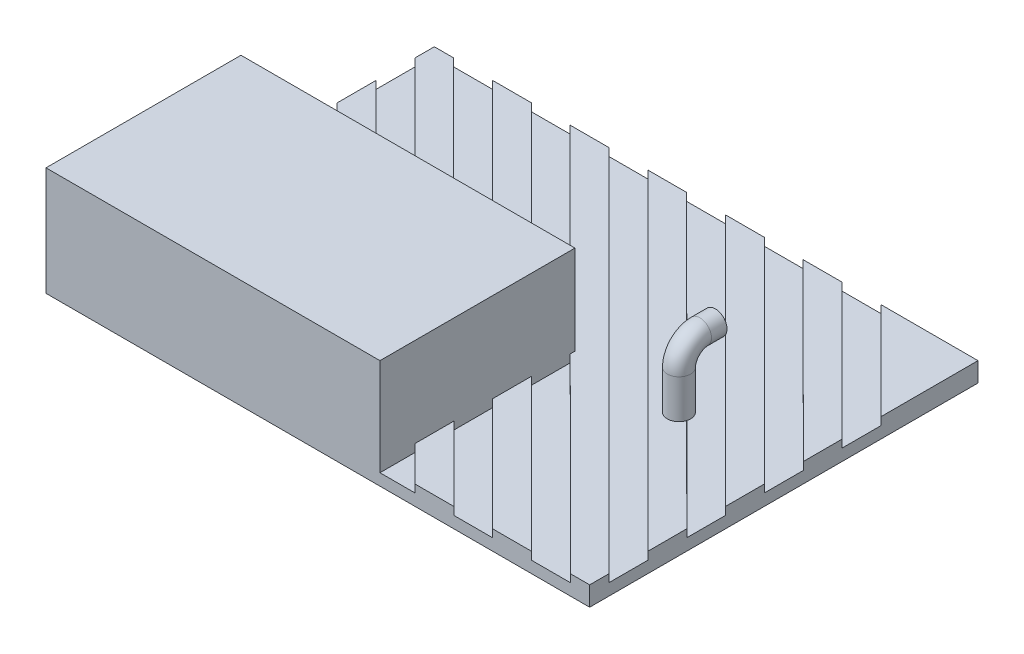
ISO-10303-21;
HEADER;
FILE_DESCRIPTION(('STEP AP214'),'2;1');
FILE_NAME('part.step','',(''),(''),'','','');
FILE_SCHEMA(('AUTOMOTIVE_DESIGN { 1 0 10303 214 1 1 1 1 }'));
ENDSEC;
DATA;
#1=APPLICATION_CONTEXT('core data for automotive mechanical design processes');
#2=APPLICATION_PROTOCOL_DEFINITION('international standard','automotive_design',2000,#1);
#3=PRODUCT_CONTEXT('',#1,'mechanical');
#4=PRODUCT('Part','Part','',(#3));
#5=PRODUCT_RELATED_PRODUCT_CATEGORY('part','',(#4));
#6=PRODUCT_DEFINITION_FORMATION('','',#4);
#7=PRODUCT_DEFINITION_CONTEXT('part definition',#1,'design');
#8=PRODUCT_DEFINITION('design','',#6,#7);
#9=PRODUCT_DEFINITION_SHAPE('','',#8);
#10=(LENGTH_UNIT() NAMED_UNIT(*) SI_UNIT(.MILLI.,.METRE.));
#11=(NAMED_UNIT(*) PLANE_ANGLE_UNIT() SI_UNIT($,.RADIAN.));
#12=(NAMED_UNIT(*) SI_UNIT($,.STERADIAN.) SOLID_ANGLE_UNIT());
#13=UNCERTAINTY_MEASURE_WITH_UNIT(LENGTH_MEASURE(1.E-05),#10,'distance_accuracy_value','');
#14=(GEOMETRIC_REPRESENTATION_CONTEXT(3) GLOBAL_UNCERTAINTY_ASSIGNED_CONTEXT((#13)) GLOBAL_UNIT_ASSIGNED_CONTEXT((#10,
#11,#12)) REPRESENTATION_CONTEXT('',''));
#15=CARTESIAN_POINT('',(0.,0.,0.));
#16=DIRECTION('',(0.,0.,1.));
#17=DIRECTION('',(1.,0.,0.));
#18=AXIS2_PLACEMENT_3D('',#15,#16,#17);
#19=CARTESIAN_POINT('',(-6.34999999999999,3.81,-127.));
#20=DIRECTION('',(0.707106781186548,0.,-0.707106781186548));
#21=DIRECTION('',(-0.707106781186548,0.,-0.707106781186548));
#22=AXIS2_PLACEMENT_3D('',#19,#20,#21);
#23=PLANE('',#22);
#24=DIRECTION('',(-0.707106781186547,0.,-0.707106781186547));
#25=VECTOR('',#24,1.);
#26=CARTESIAN_POINT('',(25.4,3.81,-95.25));
#27=LINE('',#26,#25);
#28=CARTESIAN_POINT('',(56.8870212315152,3.81,-63.7629787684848));
#29=VERTEX_POINT('',#28);
#30=CARTESIAN_POINT('',(0.,3.81,-120.65));
#31=VERTEX_POINT('',#30);
#32=EDGE_CURVE('E506',#29,#31,#27,.T.);
#33=ORIENTED_EDGE('',*,*,#32,.F.);
#34=DIRECTION('',(0.,1.,0.));
#35=VECTOR('',#34,1.);
#36=CARTESIAN_POINT('',(56.8870212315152,3.81,-63.7629787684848));
#37=LINE('',#36,#35);
#38=CARTESIAN_POINT('',(56.8870212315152,6.35,-63.7629787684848));
#39=VERTEX_POINT('',#38);
#40=EDGE_CURVE('E461',#29,#39,#37,.T.);
#41=ORIENTED_EDGE('',*,*,#40,.T.);
#42=DIRECTION('',(-0.707106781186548,0.,-0.707106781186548));
#43=VECTOR('',#42,1.);
#44=CARTESIAN_POINT('',(-6.34999999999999,6.35,-127.));
#45=LINE('',#44,#43);
#46=CARTESIAN_POINT('',(0.,6.35,-120.65));
#47=VERTEX_POINT('',#46);
#48=EDGE_CURVE('E511',#39,#47,#45,.T.);
#49=ORIENTED_EDGE('',*,*,#48,.T.);
#50=DIRECTION('',(0.,1.,0.));
#51=VECTOR('',#50,1.);
#52=CARTESIAN_POINT('',(0.,6.35,-120.65));
#53=LINE('',#52,#51);
#54=EDGE_CURVE('E730',#31,#47,#53,.T.);
#55=ORIENTED_EDGE('',*,*,#54,.F.);
#56=EDGE_LOOP('',(#33,#41,#49,#55));
#57=FACE_BOUND('',#56,.T.);
#58=ADVANCED_FACE('F50',(#57),#23,.F.);
#59=CARTESIAN_POINT('',(-152.4,3.81,0.));
#60=DIRECTION('',(0.,-1.,0.));
#61=DIRECTION('',(0.,0.,-1.));
#62=AXIS2_PLACEMENT_3D('',#59,#60,#61);
#63=PLANE('',#62);
#64=DIRECTION('',(0.707106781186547,0.,0.707106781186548));
#65=VECTOR('',#64,1.);
#66=CARTESIAN_POINT('',(25.4,3.81,-82.55));
#67=LINE('',#66,#65);
#68=CARTESIAN_POINT('',(0.,3.81,-107.95));
#69=VERTEX_POINT('',#68);
#70=CARTESIAN_POINT('',(44.1870212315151,3.81,-63.7629787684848));
#71=VERTEX_POINT('',#70);
#72=EDGE_CURVE('E505',#69,#71,#67,.T.);
#73=ORIENTED_EDGE('',*,*,#72,.T.);
#74=DIRECTION('',(-1.,0.,0.));
#75=VECTOR('',#74,1.);
#76=CARTESIAN_POINT('',(0.,3.81,-63.7629787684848));
#77=LINE('',#76,#75);
#78=EDGE_CURVE('E1064',#29,#71,#77,.T.);
#79=ORIENTED_EDGE('',*,*,#78,.F.);
#80=ORIENTED_EDGE('',*,*,#32,.T.);
#81=DIRECTION('',(0.,0.,-1.));
#82=VECTOR('',#81,1.);
#83=CARTESIAN_POINT('',(0.,3.81,0.));
#84=LINE('',#83,#82);
#85=EDGE_CURVE('E716',#69,#31,#84,.T.);
#86=ORIENTED_EDGE('',*,*,#85,.F.);
#87=EDGE_LOOP('',(#73,#79,#80,#86));
#88=FACE_BOUND('',#87,.T.);
#89=ADVANCED_FACE('F1134',(#88),#63,.F.);
#90=CARTESIAN_POINT('',(19.05,3.81,-127.));
#91=DIRECTION('',(0.707106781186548,0.,-0.707106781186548));
#92=DIRECTION('',(-0.707106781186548,0.,-0.707106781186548));
#93=AXIS2_PLACEMENT_3D('',#90,#91,#92);
#94=PLANE('',#93);
#95=DIRECTION('',(-0.707106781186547,0.,-0.707106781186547));
#96=VECTOR('',#95,1.);
#97=CARTESIAN_POINT('',(50.8,3.81,-95.25));
#98=LINE('',#97,#96);
#99=CARTESIAN_POINT('',(82.2870212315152,3.81,-63.7629787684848));
#100=VERTEX_POINT('',#99);
#101=CARTESIAN_POINT('',(19.05,3.81,-127.));
#102=VERTEX_POINT('',#101);
#103=EDGE_CURVE('E527',#100,#102,#98,.T.);
#104=ORIENTED_EDGE('',*,*,#103,.F.);
#105=DIRECTION('',(0.,1.,0.));
#106=VECTOR('',#105,1.);
#107=CARTESIAN_POINT('',(82.2870212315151,3.81,-63.7629787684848));
#108=LINE('',#107,#106);
#109=CARTESIAN_POINT('',(82.2870212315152,6.35,-63.7629787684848));
#110=VERTEX_POINT('',#109);
#111=EDGE_CURVE('E460',#100,#110,#108,.T.);
#112=ORIENTED_EDGE('',*,*,#111,.T.);
#113=DIRECTION('',(-0.707106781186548,0.,-0.707106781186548));
#114=VECTOR('',#113,1.);
#115=CARTESIAN_POINT('',(19.05,6.35,-127.));
#116=LINE('',#115,#114);
#117=CARTESIAN_POINT('',(19.05,6.35,-127.));
#118=VERTEX_POINT('',#117);
#119=EDGE_CURVE('E534',#110,#118,#116,.T.);
#120=ORIENTED_EDGE('',*,*,#119,.T.);
#121=DIRECTION('',(0.,1.,0.));
#122=VECTOR('',#121,1.);
#123=CARTESIAN_POINT('',(19.05,3.81,-127.));
#124=LINE('',#123,#122);
#125=EDGE_CURVE('E540',#102,#118,#124,.T.);
#126=ORIENTED_EDGE('',*,*,#125,.F.);
#127=EDGE_LOOP('',(#104,#112,#120,#126));
#128=FACE_BOUND('',#127,.T.);
#129=ADVANCED_FACE('F1143',(#128),#94,.F.);
#130=CARTESIAN_POINT('',(176.523585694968,3.81,43.1735856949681));
#131=DIRECTION('',(-0.707106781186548,0.,0.707106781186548));
#132=DIRECTION('',(0.707106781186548,0.,0.707106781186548));
#133=AXIS2_PLACEMENT_3D('',#130,#131,#132);
#134=PLANE('',#133);
#135=DIRECTION('',(0.707106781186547,0.,0.707106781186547));
#136=VECTOR('',#135,1.);
#137=CARTESIAN_POINT('',(176.523585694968,6.35,43.1735856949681));
#138=LINE('',#137,#136);
#139=CARTESIAN_POINT('',(6.34999999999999,6.35,-127.));
#140=VERTEX_POINT('',#139);
#141=CARTESIAN_POINT('',(69.5870212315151,6.35,-63.7629787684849));
#142=VERTEX_POINT('',#141);
#143=EDGE_CURVE('E430',#140,#142,#138,.T.);
#144=ORIENTED_EDGE('',*,*,#143,.T.);
#145=DIRECTION('',(0.,-1.,0.));
#146=VECTOR('',#145,1.);
#147=CARTESIAN_POINT('',(69.5870212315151,3.81,-63.7629787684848));
#148=LINE('',#147,#146);
#149=CARTESIAN_POINT('',(69.5870212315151,3.81,-63.7629787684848));
#150=VERTEX_POINT('',#149);
#151=EDGE_CURVE('E452',#142,#150,#148,.T.);
#152=ORIENTED_EDGE('',*,*,#151,.T.);
#153=DIRECTION('',(0.707106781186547,0.,0.707106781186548));
#154=VECTOR('',#153,1.);
#155=CARTESIAN_POINT('',(50.8,3.81,-82.55));
#156=LINE('',#155,#154);
#157=CARTESIAN_POINT('',(6.34999999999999,3.81,-127.));
#158=VERTEX_POINT('',#157);
#159=EDGE_CURVE('E525',#158,#150,#156,.T.);
#160=ORIENTED_EDGE('',*,*,#159,.F.);
#161=DIRECTION('',(0.,1.,0.));
#162=VECTOR('',#161,1.);
#163=CARTESIAN_POINT('',(6.34999999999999,3.81,-127.));
#164=LINE('',#163,#162);
#165=EDGE_CURVE('E526',#158,#140,#164,.T.);
#166=ORIENTED_EDGE('',*,*,#165,.T.);
#167=EDGE_LOOP('',(#144,#152,#160,#166));
#168=FACE_BOUND('',#167,.T.);
#169=ADVANCED_FACE('F1034',(#168),#134,.F.);
#170=CARTESIAN_POINT('',(-127.,3.81,0.));
#171=DIRECTION('',(0.,-1.,0.));
#172=DIRECTION('',(0.,0.,-1.));
#173=AXIS2_PLACEMENT_3D('',#170,#171,#172);
#174=PLANE('',#173);
#175=ORIENTED_EDGE('',*,*,#159,.T.);
#176=EDGE_CURVE('E1057',#100,#150,#77,.T.);
#177=ORIENTED_EDGE('',*,*,#176,.F.);
#178=ORIENTED_EDGE('',*,*,#103,.T.);
#179=DIRECTION('',(-1.,0.,0.));
#180=VECTOR('',#179,1.);
#181=CARTESIAN_POINT('',(6.34999999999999,3.81,-127.));
#182=LINE('',#181,#180);
#183=EDGE_CURVE('E520',#102,#158,#182,.T.);
#184=ORIENTED_EDGE('',*,*,#183,.T.);
#185=EDGE_LOOP('',(#175,#177,#178,#184));
#186=FACE_BOUND('',#185,.T.);
#187=ADVANCED_FACE('F1036',(#186),#174,.F.);
#188=CARTESIAN_POINT('',(44.45,3.81,-127.));
#189=DIRECTION('',(0.707106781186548,0.,-0.707106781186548));
#190=DIRECTION('',(-0.707106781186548,0.,-0.707106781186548));
#191=AXIS2_PLACEMENT_3D('',#188,#189,#190);
#192=PLANE('',#191);
#193=DIRECTION('',(-0.707106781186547,0.,-0.707106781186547));
#194=VECTOR('',#193,1.);
#195=CARTESIAN_POINT('',(76.2,3.81,-95.25));
#196=LINE('',#195,#194);
#197=CARTESIAN_POINT('',(107.687021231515,3.81,-63.7629787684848));
#198=VERTEX_POINT('',#197);
#199=CARTESIAN_POINT('',(44.45,3.81,-127.));
#200=VERTEX_POINT('',#199);
#201=EDGE_CURVE('E555',#198,#200,#196,.T.);
#202=ORIENTED_EDGE('',*,*,#201,.F.);
#203=DIRECTION('',(0.,1.,0.));
#204=VECTOR('',#203,1.);
#205=CARTESIAN_POINT('',(107.687021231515,3.81,-63.7629787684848));
#206=LINE('',#205,#204);
#207=CARTESIAN_POINT('',(107.687021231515,6.35,-63.7629787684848));
#208=VERTEX_POINT('',#207);
#209=EDGE_CURVE('E446',#198,#208,#206,.T.);
#210=ORIENTED_EDGE('',*,*,#209,.T.);
#211=DIRECTION('',(-0.707106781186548,0.,-0.707106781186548));
#212=VECTOR('',#211,1.);
#213=CARTESIAN_POINT('',(44.45,6.35,-127.));
#214=LINE('',#213,#212);
#215=CARTESIAN_POINT('',(44.45,6.35,-127.));
#216=VERTEX_POINT('',#215);
#217=EDGE_CURVE('E563',#208,#216,#214,.T.);
#218=ORIENTED_EDGE('',*,*,#217,.T.);
#219=DIRECTION('',(0.,1.,0.));
#220=VECTOR('',#219,1.);
#221=CARTESIAN_POINT('',(44.45,3.81,-127.));
#222=LINE('',#221,#220);
#223=EDGE_CURVE('E566',#200,#216,#222,.T.);
#224=ORIENTED_EDGE('',*,*,#223,.F.);
#225=EDGE_LOOP('',(#202,#210,#218,#224));
#226=FACE_BOUND('',#225,.T.);
#227=ADVANCED_FACE('F1290',(#226),#192,.F.);
#228=CARTESIAN_POINT('',(201.923585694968,3.81,43.1735856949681));
#229=DIRECTION('',(-0.707106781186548,0.,0.707106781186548));
#230=DIRECTION('',(0.707106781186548,0.,0.707106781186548));
#231=AXIS2_PLACEMENT_3D('',#228,#229,#230);
#232=PLANE('',#231);
#233=DIRECTION('',(0.707106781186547,0.,0.707106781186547));
#234=VECTOR('',#233,1.);
#235=CARTESIAN_POINT('',(201.923585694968,6.35,43.1735856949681));
#236=LINE('',#235,#234);
#237=CARTESIAN_POINT('',(31.75,6.35,-127.));
#238=VERTEX_POINT('',#237);
#239=CARTESIAN_POINT('',(94.9870212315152,6.35,-63.7629787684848));
#240=VERTEX_POINT('',#239);
#241=EDGE_CURVE('E557',#238,#240,#236,.T.);
#242=ORIENTED_EDGE('',*,*,#241,.T.);
#243=DIRECTION('',(0.,-1.,0.));
#244=VECTOR('',#243,1.);
#245=CARTESIAN_POINT('',(94.9870212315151,3.81,-63.7629787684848));
#246=LINE('',#245,#244);
#247=CARTESIAN_POINT('',(94.9870212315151,3.81,-63.7629787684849));
#248=VERTEX_POINT('',#247);
#249=EDGE_CURVE('E447',#240,#248,#246,.T.);
#250=ORIENTED_EDGE('',*,*,#249,.T.);
#251=DIRECTION('',(0.707106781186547,0.,0.707106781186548));
#252=VECTOR('',#251,1.);
#253=CARTESIAN_POINT('',(76.2,3.81,-82.55));
#254=LINE('',#253,#252);
#255=CARTESIAN_POINT('',(31.75,3.81,-127.));
#256=VERTEX_POINT('',#255);
#257=EDGE_CURVE('E546',#256,#248,#254,.T.);
#258=ORIENTED_EDGE('',*,*,#257,.F.);
#259=DIRECTION('',(0.,1.,0.));
#260=VECTOR('',#259,1.);
#261=CARTESIAN_POINT('',(31.75,3.81,-127.));
#262=LINE('',#261,#260);
#263=EDGE_CURVE('E559',#256,#238,#262,.T.);
#264=ORIENTED_EDGE('',*,*,#263,.T.);
#265=EDGE_LOOP('',(#242,#250,#258,#264));
#266=FACE_BOUND('',#265,.T.);
#267=ADVANCED_FACE('F1049',(#266),#232,.F.);
#268=CARTESIAN_POINT('',(-101.6,3.81,0.));
#269=DIRECTION('',(0.,-1.,0.));
#270=DIRECTION('',(0.,0.,-1.));
#271=AXIS2_PLACEMENT_3D('',#268,#269,#270);
#272=PLANE('',#271);
#273=ORIENTED_EDGE('',*,*,#257,.T.);
#274=EDGE_CURVE('E1054',#198,#248,#77,.T.);
#275=ORIENTED_EDGE('',*,*,#274,.F.);
#276=ORIENTED_EDGE('',*,*,#201,.T.);
#277=DIRECTION('',(-1.,0.,0.));
#278=VECTOR('',#277,1.);
#279=CARTESIAN_POINT('',(31.75,3.81,-127.));
#280=LINE('',#279,#278);
#281=EDGE_CURVE('E541',#200,#256,#280,.T.);
#282=ORIENTED_EDGE('',*,*,#281,.T.);
#283=EDGE_LOOP('',(#273,#275,#276,#282));
#284=FACE_BOUND('',#283,.T.);
#285=ADVANCED_FACE('F1307',(#284),#272,.F.);
#286=CARTESIAN_POINT('',(0.,6.35,0.));
#287=DIRECTION('',(0.,-1.,0.));
#288=DIRECTION('',(0.,0.,-1.));
#289=AXIS2_PLACEMENT_3D('',#286,#287,#288);
#290=PLANE('',#289);
#291=DIRECTION('',(-1.,0.,0.));
#292=VECTOR('',#291,1.);
#293=CARTESIAN_POINT('',(0.,6.35,-127.));
#294=LINE('',#293,#292);
#295=CARTESIAN_POINT('',(57.15,6.35,-127.));
#296=VERTEX_POINT('',#295);
#297=EDGE_CURVE('E968',#296,#216,#294,.T.);
#298=ORIENTED_EDGE('',*,*,#297,.T.);
#299=ORIENTED_EDGE('',*,*,#217,.F.);
#300=DIRECTION('',(-1.,0.,0.));
#301=VECTOR('',#300,1.);
#302=CARTESIAN_POINT('',(96.52,6.35,-63.7629787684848));
#303=LINE('',#302,#301);
#304=CARTESIAN_POINT('',(109.22,6.35,-63.7629787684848));
#305=VERTEX_POINT('',#304);
#306=EDGE_CURVE('E411',#305,#208,#303,.T.);
#307=ORIENTED_EDGE('',*,*,#306,.F.);
#308=DIRECTION('',(0.,0.,-1.));
#309=VECTOR('',#308,1.);
#310=CARTESIAN_POINT('',(109.22,6.35,-63.7629787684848));
#311=LINE('',#310,#309);
#312=CARTESIAN_POINT('',(109.22,6.35,-62.23));
#313=VERTEX_POINT('',#312);
#314=EDGE_CURVE('E420',#313,#305,#311,.T.);
#315=ORIENTED_EDGE('',*,*,#314,.F.);
#316=CARTESIAN_POINT('',(171.45,6.35,0.));
#317=VERTEX_POINT('',#316);
#318=EDGE_CURVE('E549',#317,#313,#214,.T.);
#319=ORIENTED_EDGE('',*,*,#318,.F.);
#320=DIRECTION('',(1.,0.,0.));
#321=VECTOR('',#320,1.);
#322=CARTESIAN_POINT('',(0.,6.35,0.));
#323=LINE('',#322,#321);
#324=CARTESIAN_POINT('',(177.8,6.35,0.));
#325=VERTEX_POINT('',#324);
#326=EDGE_CURVE('E880',#317,#325,#323,.T.);
#327=ORIENTED_EDGE('',*,*,#326,.T.);
#328=DIRECTION('',(0.,0.,-1.));
#329=VECTOR('',#328,1.);
#330=CARTESIAN_POINT('',(177.8,6.35,0.));
#331=LINE('',#330,#329);
#332=CARTESIAN_POINT('',(177.8,6.35,-6.34999999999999));
#333=VERTEX_POINT('',#332);
#334=EDGE_CURVE('E882',#325,#333,#331,.T.);
#335=ORIENTED_EDGE('',*,*,#334,.T.);
#336=DIRECTION('',(0.707106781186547,0.,0.707106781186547));
#337=VECTOR('',#336,1.);
#338=CARTESIAN_POINT('',(227.323585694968,6.35,43.1735856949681));
#339=LINE('',#338,#337);
#340=EDGE_CURVE('E569',#296,#333,#339,.T.);
#341=ORIENTED_EDGE('',*,*,#340,.F.);
#342=EDGE_LOOP('',(#298,#299,#307,#315,#319,#327,#335,#341));
#343=FACE_BOUND('',#342,.T.);
#344=ADVANCED_FACE('F1251',(#343),#290,.F.);
#345=CARTESIAN_POINT('',(146.05,6.35,0.));
#346=VERTEX_POINT('',#345);
#347=CARTESIAN_POINT('',(158.75,6.35,0.));
#348=VERTEX_POINT('',#347);
#349=EDGE_CURVE('E884',#346,#348,#323,.T.);
#350=ORIENTED_EDGE('',*,*,#349,.T.);
#351=CARTESIAN_POINT('',(109.22,6.35,-49.53));
#352=VERTEX_POINT('',#351);
#353=EDGE_CURVE('E542',#352,#348,#236,.T.);
#354=ORIENTED_EDGE('',*,*,#353,.F.);
#355=CARTESIAN_POINT('',(109.22,6.35,-36.83));
#356=VERTEX_POINT('',#355);
#357=EDGE_CURVE('E413',#356,#352,#311,.T.);
#358=ORIENTED_EDGE('',*,*,#357,.F.);
#359=EDGE_CURVE('E522',#346,#356,#116,.T.);
#360=ORIENTED_EDGE('',*,*,#359,.F.);
#361=EDGE_LOOP('',(#350,#354,#358,#360));
#362=FACE_BOUND('',#361,.T.);
#363=ADVANCED_FACE('F1500',(#362),#290,.F.);
#364=CARTESIAN_POINT('',(120.65,6.35,0.));
#365=VERTEX_POINT('',#364);
#366=CARTESIAN_POINT('',(133.35,6.35,0.));
#367=VERTEX_POINT('',#366);
#368=EDGE_CURVE('E422',#365,#367,#323,.T.);
#369=ORIENTED_EDGE('',*,*,#368,.T.);
#370=CARTESIAN_POINT('',(109.22,6.35,-24.13));
#371=VERTEX_POINT('',#370);
#372=EDGE_CURVE('E419',#371,#367,#138,.T.);
#373=ORIENTED_EDGE('',*,*,#372,.F.);
#374=CARTESIAN_POINT('',(109.22,6.35,-11.43));
#375=VERTEX_POINT('',#374);
#376=EDGE_CURVE('E401',#375,#371,#311,.T.);
#377=ORIENTED_EDGE('',*,*,#376,.F.);
#378=EDGE_CURVE('E510',#365,#375,#45,.T.);
#379=ORIENTED_EDGE('',*,*,#378,.F.);
#380=EDGE_LOOP('',(#369,#373,#377,#379));
#381=FACE_BOUND('',#380,.T.);
#382=ADVANCED_FACE('F416',(#381),#290,.F.);
#383=CARTESIAN_POINT('',(107.95,6.35,-127.));
#384=VERTEX_POINT('',#383);
#385=CARTESIAN_POINT('',(95.25,6.35,-127.));
#386=VERTEX_POINT('',#385);
#387=EDGE_CURVE('E977',#384,#386,#294,.T.);
#388=ORIENTED_EDGE('',*,*,#387,.T.);
#389=DIRECTION('',(-0.707106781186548,0.,-0.707106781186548));
#390=VECTOR('',#389,1.);
#391=CARTESIAN_POINT('',(95.25,6.35,-127.));
#392=LINE('',#391,#390);
#393=CARTESIAN_POINT('',(177.8,6.35,-44.45));
#394=VERTEX_POINT('',#393);
#395=EDGE_CURVE('E602',#394,#386,#392,.T.);
#396=ORIENTED_EDGE('',*,*,#395,.F.);
#397=CARTESIAN_POINT('',(177.8,6.35,-57.15));
#398=VERTEX_POINT('',#397);
#399=EDGE_CURVE('E961',#394,#398,#331,.T.);
#400=ORIENTED_EDGE('',*,*,#399,.T.);
#401=DIRECTION('',(0.707106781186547,0.,0.707106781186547));
#402=VECTOR('',#401,1.);
#403=CARTESIAN_POINT('',(278.123585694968,6.35,43.1735856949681));
#404=LINE('',#403,#402);
#405=EDGE_CURVE('E623',#384,#398,#404,.T.);
#406=ORIENTED_EDGE('',*,*,#405,.F.);
#407=EDGE_LOOP('',(#388,#396,#400,#406));
#408=FACE_BOUND('',#407,.T.);
#409=ADVANCED_FACE('F1515',(#408),#290,.F.);
#410=CARTESIAN_POINT('',(177.8,6.35,-19.05));
#411=VERTEX_POINT('',#410);
#412=CARTESIAN_POINT('',(177.8,6.35,-31.75));
#413=VERTEX_POINT('',#412);
#414=EDGE_CURVE('E889',#411,#413,#331,.T.);
#415=ORIENTED_EDGE('',*,*,#414,.T.);
#416=DIRECTION('',(0.707106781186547,0.,0.707106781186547));
#417=VECTOR('',#416,1.);
#418=CARTESIAN_POINT('',(252.723585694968,6.35,43.1735856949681));
#419=LINE('',#418,#417);
#420=CARTESIAN_POINT('',(147.155952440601,6.35,-62.3940475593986));
#421=VERTEX_POINT('',#420);
#422=EDGE_CURVE('E591',#421,#413,#419,.T.);
#423=ORIENTED_EDGE('',*,*,#422,.F.);
#424=CARTESIAN_POINT('',(143.51,6.35,-63.5));
#425=DIRECTION('',(0.,1.,0.));
#426=DIRECTION('',(0.,0.,1.));
#427=AXIS2_PLACEMENT_3D('',#424,#425,#426);
#428=CIRCLE('',#427,3.81000000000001);
#429=CARTESIAN_POINT('',(142.404047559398,6.35,-67.1459524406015));
#430=VERTEX_POINT('',#429);
#431=EDGE_CURVE('E785',#430,#421,#428,.T.);
#432=ORIENTED_EDGE('',*,*,#431,.F.);
#433=CARTESIAN_POINT('',(82.55,6.35,-127.));
#434=VERTEX_POINT('',#433);
#435=EDGE_CURVE('E612',#434,#430,#419,.T.);
#436=ORIENTED_EDGE('',*,*,#435,.F.);
#437=CARTESIAN_POINT('',(69.85,6.35,-127.));
#438=VERTEX_POINT('',#437);
#439=EDGE_CURVE('E972',#434,#438,#294,.T.);
#440=ORIENTED_EDGE('',*,*,#439,.T.);
#441=DIRECTION('',(-0.707106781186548,0.,-0.707106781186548));
#442=VECTOR('',#441,1.);
#443=CARTESIAN_POINT('',(69.85,6.35,-127.));
#444=LINE('',#443,#442);
#445=EDGE_CURVE('E579',#411,#438,#444,.T.);
#446=ORIENTED_EDGE('',*,*,#445,.F.);
#447=EDGE_LOOP('',(#415,#423,#432,#436,#440,#446));
#448=FACE_BOUND('',#447,.T.);
#449=ADVANCED_FACE('F1516',(#448),#290,.F.);
#450=CARTESIAN_POINT('',(133.35,6.35,-127.));
#451=VERTEX_POINT('',#450);
#452=CARTESIAN_POINT('',(120.65,6.35,-127.));
#453=VERTEX_POINT('',#452);
#454=EDGE_CURVE('E897',#451,#453,#294,.T.);
#455=ORIENTED_EDGE('',*,*,#454,.T.);
#456=DIRECTION('',(-0.707106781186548,0.,-0.707106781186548));
#457=VECTOR('',#456,1.);
#458=CARTESIAN_POINT('',(120.65,6.35,-127.));
#459=LINE('',#458,#457);
#460=CARTESIAN_POINT('',(177.8,6.35,-69.85));
#461=VERTEX_POINT('',#460);
#462=EDGE_CURVE('E627',#461,#453,#459,.T.);
#463=ORIENTED_EDGE('',*,*,#462,.F.);
#464=CARTESIAN_POINT('',(177.8,6.35,-82.55));
#465=VERTEX_POINT('',#464);
#466=EDGE_CURVE('E891',#461,#465,#331,.T.);
#467=ORIENTED_EDGE('',*,*,#466,.T.);
#468=DIRECTION('',(0.707106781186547,0.,0.707106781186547));
#469=VECTOR('',#468,1.);
#470=CARTESIAN_POINT('',(303.523585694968,6.35,43.1735856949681));
#471=LINE('',#470,#469);
#472=EDGE_CURVE('E739',#451,#465,#471,.T.);
#473=ORIENTED_EDGE('',*,*,#472,.F.);
#474=EDGE_LOOP('',(#455,#463,#467,#473));
#475=FACE_BOUND('',#474,.T.);
#476=ADVANCED_FACE('F984',(#475),#290,.F.);
#477=CARTESIAN_POINT('',(177.8,6.35,-127.));
#478=VERTEX_POINT('',#477);
#479=CARTESIAN_POINT('',(146.05,6.35,-127.));
#480=VERTEX_POINT('',#479);
#481=EDGE_CURVE('E893',#478,#480,#294,.T.);
#482=ORIENTED_EDGE('',*,*,#481,.T.);
#483=DIRECTION('',(-0.707106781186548,0.,-0.707106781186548));
#484=VECTOR('',#483,1.);
#485=CARTESIAN_POINT('',(146.05,6.35,-127.));
#486=LINE('',#485,#484);
#487=CARTESIAN_POINT('',(177.8,6.35,-95.25));
#488=VERTEX_POINT('',#487);
#489=EDGE_CURVE('E744',#488,#480,#486,.T.);
#490=ORIENTED_EDGE('',*,*,#489,.F.);
#491=EDGE_CURVE('E895',#488,#478,#331,.T.);
#492=ORIENTED_EDGE('',*,*,#491,.T.);
#493=EDGE_LOOP('',(#482,#490,#492));
#494=FACE_BOUND('',#493,.T.);
#495=ADVANCED_FACE('F1009',(#494),#290,.F.);
#496=DIRECTION('',(0.,0.,-1.));
#497=VECTOR('',#496,1.);
#498=CARTESIAN_POINT('',(12.7,6.35,-63.7629787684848));
#499=LINE('',#498,#497);
#500=CARTESIAN_POINT('',(12.7,6.35,-12.9629787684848));
#501=VERTEX_POINT('',#500);
#502=CARTESIAN_POINT('',(12.7,6.35,-63.7629787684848));
#503=VERTEX_POINT('',#502);
#504=EDGE_CURVE('E844',#501,#503,#499,.T.);
#505=ORIENTED_EDGE('',*,*,#504,.F.);
#506=DIRECTION('',(-1.,0.,0.));
#507=VECTOR('',#506,1.);
#508=CARTESIAN_POINT('',(12.7,6.35,-12.9629787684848));
#509=LINE('',#508,#507);
#510=CARTESIAN_POINT('',(96.52,6.35,-12.9629787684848));
#511=VERTEX_POINT('',#510);
#512=EDGE_CURVE('E845',#511,#501,#509,.T.);
#513=ORIENTED_EDGE('',*,*,#512,.F.);
#514=DIRECTION('',(0.,0.,1.));
#515=VECTOR('',#514,1.);
#516=CARTESIAN_POINT('',(96.52,6.35,-63.7629787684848));
#517=LINE('',#516,#515);
#518=CARTESIAN_POINT('',(96.52,6.35,-63.7629787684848));
#519=VERTEX_POINT('',#518);
#520=EDGE_CURVE('E836',#519,#511,#517,.T.);
#521=ORIENTED_EDGE('',*,*,#520,.F.);
#522=DIRECTION('',(-1.,0.,0.));
#523=VECTOR('',#522,1.);
#524=CARTESIAN_POINT('',(0.,6.35,-63.7629787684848));
#525=LINE('',#524,#523);
#526=EDGE_CURVE('E1047',#519,#240,#525,.T.);
#527=ORIENTED_EDGE('',*,*,#526,.T.);
#528=ORIENTED_EDGE('',*,*,#241,.F.);
#529=EDGE_CURVE('E970',#238,#118,#294,.T.);
#530=ORIENTED_EDGE('',*,*,#529,.T.);
#531=ORIENTED_EDGE('',*,*,#119,.F.);
#532=EDGE_CURVE('E1032',#110,#142,#525,.T.);
#533=ORIENTED_EDGE('',*,*,#532,.T.);
#534=ORIENTED_EDGE('',*,*,#143,.F.);
#535=CARTESIAN_POINT('',(0.,6.35,-127.));
#536=VERTEX_POINT('',#535);
#537=EDGE_CURVE('E887',#140,#536,#294,.T.);
#538=ORIENTED_EDGE('',*,*,#537,.T.);
#539=DIRECTION('',(0.,0.,1.));
#540=VECTOR('',#539,1.);
#541=CARTESIAN_POINT('',(0.,6.35,0.));
#542=LINE('',#541,#540);
#543=EDGE_CURVE('E871',#536,#47,#542,.T.);
#544=ORIENTED_EDGE('',*,*,#543,.T.);
#545=ORIENTED_EDGE('',*,*,#48,.F.);
#546=CARTESIAN_POINT('',(44.1870212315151,6.35,-63.7629787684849));
#547=VERTEX_POINT('',#546);
#548=EDGE_CURVE('E1081',#39,#547,#525,.T.);
#549=ORIENTED_EDGE('',*,*,#548,.T.);
#550=DIRECTION('',(0.707106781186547,0.,0.707106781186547));
#551=VECTOR('',#550,1.);
#552=CARTESIAN_POINT('',(151.123585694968,6.35,43.1735856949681));
#553=LINE('',#552,#551);
#554=CARTESIAN_POINT('',(0.,6.35,-107.95));
#555=VERTEX_POINT('',#554);
#556=EDGE_CURVE('E496',#555,#547,#553,.T.);
#557=ORIENTED_EDGE('',*,*,#556,.F.);
#558=CARTESIAN_POINT('',(0.,6.35,-95.25));
#559=VERTEX_POINT('',#558);
#560=EDGE_CURVE('E879',#555,#559,#542,.T.);
#561=ORIENTED_EDGE('',*,*,#560,.T.);
#562=DIRECTION('',(-0.707106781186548,0.,-0.707106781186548));
#563=VECTOR('',#562,1.);
#564=CARTESIAN_POINT('',(-31.75,6.35,-127.));
#565=LINE('',#564,#563);
#566=CARTESIAN_POINT('',(31.4870212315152,6.35,-63.7629787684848));
#567=VERTEX_POINT('',#566);
#568=EDGE_CURVE('E491',#567,#559,#565,.T.);
#569=ORIENTED_EDGE('',*,*,#568,.F.);
#570=CARTESIAN_POINT('',(18.7870212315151,6.35,-63.7629787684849));
#571=VERTEX_POINT('',#570);
#572=EDGE_CURVE('E1079',#567,#571,#525,.T.);
#573=ORIENTED_EDGE('',*,*,#572,.T.);
#574=DIRECTION('',(0.707106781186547,0.,0.707106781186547));
#575=VECTOR('',#574,1.);
#576=CARTESIAN_POINT('',(125.723585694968,6.35,43.1735856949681));
#577=LINE('',#576,#575);
#578=CARTESIAN_POINT('',(0.,6.35,-82.55));
#579=VERTEX_POINT('',#578);
#580=EDGE_CURVE('E481',#579,#571,#577,.T.);
#581=ORIENTED_EDGE('',*,*,#580,.F.);
#582=CARTESIAN_POINT('',(0.,6.35,-69.85));
#583=VERTEX_POINT('',#582);
#584=EDGE_CURVE('E883',#579,#583,#542,.T.);
#585=ORIENTED_EDGE('',*,*,#584,.T.);
#586=DIRECTION('',(-0.707106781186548,0.,-0.707106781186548));
#587=VECTOR('',#586,1.);
#588=CARTESIAN_POINT('',(-57.15,6.35,-127.));
#589=LINE('',#588,#587);
#590=CARTESIAN_POINT('',(6.08702123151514,6.35,-63.7629787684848));
#591=VERTEX_POINT('',#590);
#592=EDGE_CURVE('E482',#591,#583,#589,.T.);
#593=ORIENTED_EDGE('',*,*,#592,.F.);
#594=DIRECTION('',(-1.,0.,0.));
#595=VECTOR('',#594,1.);
#596=CARTESIAN_POINT('',(0.,6.35,-63.7629787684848));
#597=LINE('',#596,#595);
#598=EDGE_CURVE('E828',#503,#591,#597,.T.);
#599=ORIENTED_EDGE('',*,*,#598,.F.);
#600=EDGE_LOOP('',(#505,#513,#521,#527,#528,#530,#531,#533,#534,#538,#544,#545,#549,#557,#561,
#569,#573,#581,#585,#593,#599));
#601=FACE_BOUND('',#600,.T.);
#602=ADVANCED_FACE('F1030',(#601),#290,.F.);
#603=CARTESIAN_POINT('',(0.,6.35,0.));
#604=DIRECTION('',(1.,0.,0.));
#605=DIRECTION('',(0.,0.,-1.));
#606=AXIS2_PLACEMENT_3D('',#603,#604,#605);
#607=PLANE('',#606);
#608=DIRECTION('',(0.,0.,1.));
#609=VECTOR('',#608,1.);
#610=CARTESIAN_POINT('',(0.,0.,0.));
#611=LINE('',#610,#609);
#612=CARTESIAN_POINT('',(0.,0.,-127.));
#613=VERTEX_POINT('',#612);
#614=CARTESIAN_POINT('',(0.,0.,0.));
#615=VERTEX_POINT('',#614);
#616=EDGE_CURVE('E874',#613,#615,#611,.T.);
#617=ORIENTED_EDGE('',*,*,#616,.T.);
#618=DIRECTION('',(0.,-1.,0.));
#619=VECTOR('',#618,1.);
#620=CARTESIAN_POINT('',(0.,6.35,0.));
#621=LINE('',#620,#619);
#622=CARTESIAN_POINT('',(0.,35.56,0.));
#623=VERTEX_POINT('',#622);
#624=EDGE_CURVE('E925',#623,#615,#621,.T.);
#625=ORIENTED_EDGE('',*,*,#624,.F.);
#626=DIRECTION('',(0.,0.,1.));
#627=VECTOR('',#626,1.);
#628=CARTESIAN_POINT('',(0.,35.56,0.));
#629=LINE('',#628,#627);
#630=CARTESIAN_POINT('',(0.,35.56,-63.7629787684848));
#631=VERTEX_POINT('',#630);
#632=EDGE_CURVE('E801',#631,#623,#629,.T.);
#633=ORIENTED_EDGE('',*,*,#632,.F.);
#634=DIRECTION('',(0.,-1.,0.));
#635=VECTOR('',#634,1.);
#636=CARTESIAN_POINT('',(0.,29.21,-63.7629787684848));
#637=LINE('',#636,#635);
#638=CARTESIAN_POINT('',(0.,3.81,-63.7629787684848));
#639=VERTEX_POINT('',#638);
#640=EDGE_CURVE('E62',#631,#639,#637,.T.);
#641=ORIENTED_EDGE('',*,*,#640,.T.);
#642=DIRECTION('',(0.,0.,-1.));
#643=VECTOR('',#642,1.);
#644=CARTESIAN_POINT('',(0.,3.81,0.));
#645=LINE('',#644,#643);
#646=CARTESIAN_POINT('',(0.,3.81,-69.85));
#647=VERTEX_POINT('',#646);
#648=EDGE_CURVE('E731',#639,#647,#645,.T.);
#649=ORIENTED_EDGE('',*,*,#648,.T.);
#650=DIRECTION('',(0.,1.,0.));
#651=VECTOR('',#650,1.);
#652=CARTESIAN_POINT('',(0.,6.35,-69.85));
#653=LINE('',#652,#651);
#654=EDGE_CURVE('E733',#647,#583,#653,.T.);
#655=ORIENTED_EDGE('',*,*,#654,.T.);
#656=ORIENTED_EDGE('',*,*,#584,.F.);
#657=DIRECTION('',(0.,-1.,0.));
#658=VECTOR('',#657,1.);
#659=CARTESIAN_POINT('',(0.,6.35,-82.55));
#660=LINE('',#659,#658);
#661=CARTESIAN_POINT('',(0.,3.81,-82.55));
#662=VERTEX_POINT('',#661);
#663=EDGE_CURVE('E711',#579,#662,#660,.T.);
#664=ORIENTED_EDGE('',*,*,#663,.T.);
#665=DIRECTION('',(0.,0.,-1.));
#666=VECTOR('',#665,1.);
#667=CARTESIAN_POINT('',(0.,3.81,0.));
#668=LINE('',#667,#666);
#669=CARTESIAN_POINT('',(0.,3.81,-95.25));
#670=VERTEX_POINT('',#669);
#671=EDGE_CURVE('E710',#662,#670,#668,.T.);
#672=ORIENTED_EDGE('',*,*,#671,.T.);
#673=DIRECTION('',(0.,1.,0.));
#674=VECTOR('',#673,1.);
#675=CARTESIAN_POINT('',(0.,6.35,-95.25));
#676=LINE('',#675,#674);
#677=EDGE_CURVE('E714',#670,#559,#676,.T.);
#678=ORIENTED_EDGE('',*,*,#677,.T.);
#679=ORIENTED_EDGE('',*,*,#560,.F.);
#680=DIRECTION('',(0.,-1.,0.));
#681=VECTOR('',#680,1.);
#682=CARTESIAN_POINT('',(0.,6.35,-107.95));
#683=LINE('',#682,#681);
#684=EDGE_CURVE('E723',#555,#69,#683,.T.);
#685=ORIENTED_EDGE('',*,*,#684,.T.);
#686=ORIENTED_EDGE('',*,*,#85,.T.);
#687=ORIENTED_EDGE('',*,*,#54,.T.);
#688=ORIENTED_EDGE('',*,*,#543,.F.);
#689=DIRECTION('',(0.,-1.,0.));
#690=VECTOR('',#689,1.);
#691=CARTESIAN_POINT('',(0.,6.35,-127.));
#692=LINE('',#691,#690);
#693=EDGE_CURVE('E900',#536,#613,#692,.T.);
#694=ORIENTED_EDGE('',*,*,#693,.T.);
#695=EDGE_LOOP('',(#617,#625,#633,#641,#649,#655,#656,#664,#672,#678,#679,#685,#686,#687,#688,#694));
#696=FACE_BOUND('',#695,.T.);
#697=ADVANCED_FACE('F47',(#696),#607,.F.);
#698=CARTESIAN_POINT('',(0.,6.35,0.));
#699=DIRECTION('',(0.,0.,-1.));
#700=DIRECTION('',(-1.,0.,0.));
#701=AXIS2_PLACEMENT_3D('',#698,#699,#700);
#702=PLANE('',#701);
#703=ORIENTED_EDGE('',*,*,#624,.T.);
#704=DIRECTION('',(1.,0.,0.));
#705=VECTOR('',#704,1.);
#706=CARTESIAN_POINT('',(0.,0.,0.));
#707=LINE('',#706,#705);
#708=CARTESIAN_POINT('',(177.8,0.,0.));
#709=VERTEX_POINT('',#708);
#710=EDGE_CURVE('E905',#615,#709,#707,.T.);
#711=ORIENTED_EDGE('',*,*,#710,.T.);
#712=DIRECTION('',(0.,-1.,0.));
#713=VECTOR('',#712,1.);
#714=CARTESIAN_POINT('',(177.8,6.35,0.));
#715=LINE('',#714,#713);
#716=EDGE_CURVE('E918',#325,#709,#715,.T.);
#717=ORIENTED_EDGE('',*,*,#716,.F.);
#718=ORIENTED_EDGE('',*,*,#326,.F.);
#719=DIRECTION('',(0.,-1.,0.));
#720=VECTOR('',#719,1.);
#721=CARTESIAN_POINT('',(171.45,6.35,0.));
#722=LINE('',#721,#720);
#723=CARTESIAN_POINT('',(171.45,3.81,0.));
#724=VERTEX_POINT('',#723);
#725=EDGE_CURVE('E702',#317,#724,#722,.T.);
#726=ORIENTED_EDGE('',*,*,#725,.T.);
#727=DIRECTION('',(-1.,0.,0.));
#728=VECTOR('',#727,1.);
#729=CARTESIAN_POINT('',(0.,3.81,0.));
#730=LINE('',#729,#728);
#731=CARTESIAN_POINT('',(158.75,3.81,0.));
#732=VERTEX_POINT('',#731);
#733=EDGE_CURVE('E694',#724,#732,#730,.T.);
#734=ORIENTED_EDGE('',*,*,#733,.T.);
#735=DIRECTION('',(0.,1.,0.));
#736=VECTOR('',#735,1.);
#737=CARTESIAN_POINT('',(158.75,6.35,0.));
#738=LINE('',#737,#736);
#739=EDGE_CURVE('E697',#732,#348,#738,.T.);
#740=ORIENTED_EDGE('',*,*,#739,.T.);
#741=ORIENTED_EDGE('',*,*,#349,.F.);
#742=DIRECTION('',(0.,-1.,0.));
#743=VECTOR('',#742,1.);
#744=CARTESIAN_POINT('',(146.05,6.35,0.));
#745=LINE('',#744,#743);
#746=CARTESIAN_POINT('',(146.05,3.81,0.));
#747=VERTEX_POINT('',#746);
#748=EDGE_CURVE('E691',#346,#747,#745,.T.);
#749=ORIENTED_EDGE('',*,*,#748,.T.);
#750=DIRECTION('',(-1.,0.,0.));
#751=VECTOR('',#750,1.);
#752=CARTESIAN_POINT('',(0.,3.81,0.));
#753=LINE('',#752,#751);
#754=CARTESIAN_POINT('',(133.35,3.81,0.));
#755=VERTEX_POINT('',#754);
#756=EDGE_CURVE('E685',#747,#755,#753,.T.);
#757=ORIENTED_EDGE('',*,*,#756,.T.);
#758=DIRECTION('',(0.,1.,0.));
#759=VECTOR('',#758,1.);
#760=CARTESIAN_POINT('',(133.35,6.35,0.));
#761=LINE('',#760,#759);
#762=EDGE_CURVE('E686',#755,#367,#761,.T.);
#763=ORIENTED_EDGE('',*,*,#762,.T.);
#764=ORIENTED_EDGE('',*,*,#368,.F.);
#765=DIRECTION('',(0.,-1.,0.));
#766=VECTOR('',#765,1.);
#767=CARTESIAN_POINT('',(120.65,6.35,0.));
#768=LINE('',#767,#766);
#769=CARTESIAN_POINT('',(120.65,3.81,0.));
#770=VERTEX_POINT('',#769);
#771=EDGE_CURVE('E11',#365,#770,#768,.T.);
#772=ORIENTED_EDGE('',*,*,#771,.T.);
#773=DIRECTION('',(-1.,0.,0.));
#774=VECTOR('',#773,1.);
#775=CARTESIAN_POINT('',(0.,3.81,0.));
#776=LINE('',#775,#774);
#777=CARTESIAN_POINT('',(109.22,3.81,0.));
#778=VERTEX_POINT('',#777);
#779=EDGE_CURVE('E57',#770,#778,#776,.T.);
#780=ORIENTED_EDGE('',*,*,#779,.T.);
#781=DIRECTION('',(0.,-1.,0.));
#782=VECTOR('',#781,1.);
#783=CARTESIAN_POINT('',(109.22,29.21,0.));
#784=LINE('',#783,#782);
#785=CARTESIAN_POINT('',(109.22,35.56,0.));
#786=VERTEX_POINT('',#785);
#787=EDGE_CURVE('E872',#786,#778,#784,.T.);
#788=ORIENTED_EDGE('',*,*,#787,.F.);
#789=DIRECTION('',(1.,0.,0.));
#790=VECTOR('',#789,1.);
#791=CARTESIAN_POINT('',(0.,35.56,0.));
#792=LINE('',#791,#790);
#793=EDGE_CURVE('E808',#623,#786,#792,.T.);
#794=ORIENTED_EDGE('',*,*,#793,.F.);
#795=EDGE_LOOP('',(#703,#711,#717,#718,#726,#734,#740,#741,#749,#757,#763,#764,#772,#780,#788,#794));
#796=FACE_BOUND('',#795,.T.);
#797=ADVANCED_FACE('F930',(#796),#702,.F.);
#798=CARTESIAN_POINT('',(177.8,6.35,0.));
#799=DIRECTION('',(-1.,0.,0.));
#800=DIRECTION('',(0.,0.,1.));
#801=AXIS2_PLACEMENT_3D('',#798,#799,#800);
#802=PLANE('',#801);
#803=ORIENTED_EDGE('',*,*,#399,.F.);
#804=DIRECTION('',(0.,-1.,0.));
#805=VECTOR('',#804,1.);
#806=CARTESIAN_POINT('',(177.8,6.35,-44.45));
#807=LINE('',#806,#805);
#808=CARTESIAN_POINT('',(177.8,3.81,-44.45));
#809=VERTEX_POINT('',#808);
#810=EDGE_CURVE('E676',#394,#809,#807,.T.);
#811=ORIENTED_EDGE('',*,*,#810,.T.);
#812=DIRECTION('',(0.,0.,1.));
#813=VECTOR('',#812,1.);
#814=CARTESIAN_POINT('',(177.8,3.81,0.));
#815=LINE('',#814,#813);
#816=CARTESIAN_POINT('',(177.8,3.81,-31.75));
#817=VERTEX_POINT('',#816);
#818=EDGE_CURVE('E675',#809,#817,#815,.T.);
#819=ORIENTED_EDGE('',*,*,#818,.T.);
#820=DIRECTION('',(0.,1.,0.));
#821=VECTOR('',#820,1.);
#822=CARTESIAN_POINT('',(177.8,6.35,-31.75));
#823=LINE('',#822,#821);
#824=EDGE_CURVE('E677',#817,#413,#823,.T.);
#825=ORIENTED_EDGE('',*,*,#824,.T.);
#826=ORIENTED_EDGE('',*,*,#414,.F.);
#827=DIRECTION('',(0.,-1.,0.));
#828=VECTOR('',#827,1.);
#829=CARTESIAN_POINT('',(177.8,6.35,-19.05));
#830=LINE('',#829,#828);
#831=CARTESIAN_POINT('',(177.8,3.81,-19.05));
#832=VERTEX_POINT('',#831);
#833=EDGE_CURVE('E667',#411,#832,#830,.T.);
#834=ORIENTED_EDGE('',*,*,#833,.T.);
#835=DIRECTION('',(0.,0.,1.));
#836=VECTOR('',#835,1.);
#837=CARTESIAN_POINT('',(177.8,3.81,0.));
#838=LINE('',#837,#836);
#839=CARTESIAN_POINT('',(177.8,3.81,-6.34999999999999));
#840=VERTEX_POINT('',#839);
#841=EDGE_CURVE('E656',#832,#840,#838,.T.);
#842=ORIENTED_EDGE('',*,*,#841,.T.);
#843=DIRECTION('',(0.,1.,0.));
#844=VECTOR('',#843,1.);
#845=CARTESIAN_POINT('',(177.8,6.35,-6.35));
#846=LINE('',#845,#844);
#847=EDGE_CURVE('E664',#840,#333,#846,.T.);
#848=ORIENTED_EDGE('',*,*,#847,.T.);
#849=ORIENTED_EDGE('',*,*,#334,.F.);
#850=ORIENTED_EDGE('',*,*,#716,.T.);
#851=DIRECTION('',(0.,0.,-1.));
#852=VECTOR('',#851,1.);
#853=CARTESIAN_POINT('',(177.8,0.,0.));
#854=LINE('',#853,#852);
#855=CARTESIAN_POINT('',(177.8,0.,-127.));
#856=VERTEX_POINT('',#855);
#857=EDGE_CURVE('E903',#709,#856,#854,.T.);
#858=ORIENTED_EDGE('',*,*,#857,.T.);
#859=DIRECTION('',(0.,-1.,0.));
#860=VECTOR('',#859,1.);
#861=CARTESIAN_POINT('',(177.8,6.35,-127.));
#862=LINE('',#861,#860);
#863=EDGE_CURVE('E911',#478,#856,#862,.T.);
#864=ORIENTED_EDGE('',*,*,#863,.F.);
#865=ORIENTED_EDGE('',*,*,#491,.F.);
#866=DIRECTION('',(0.,-1.,0.));
#867=VECTOR('',#866,1.);
#868=CARTESIAN_POINT('',(177.8,6.35,-95.25));
#869=LINE('',#868,#867);
#870=CARTESIAN_POINT('',(177.8,3.81,-95.25));
#871=VERTEX_POINT('',#870);
#872=EDGE_CURVE('E775',#488,#871,#869,.T.);
#873=ORIENTED_EDGE('',*,*,#872,.T.);
#874=DIRECTION('',(0.,0.,1.));
#875=VECTOR('',#874,1.);
#876=CARTESIAN_POINT('',(177.8,3.81,0.));
#877=LINE('',#876,#875);
#878=CARTESIAN_POINT('',(177.8,3.81,-82.55));
#879=VERTEX_POINT('',#878);
#880=EDGE_CURVE('E765',#871,#879,#877,.T.);
#881=ORIENTED_EDGE('',*,*,#880,.T.);
#882=DIRECTION('',(0.,1.,0.));
#883=VECTOR('',#882,1.);
#884=CARTESIAN_POINT('',(177.8,6.35,-82.55));
#885=LINE('',#884,#883);
#886=EDGE_CURVE('E767',#879,#465,#885,.T.);
#887=ORIENTED_EDGE('',*,*,#886,.T.);
#888=ORIENTED_EDGE('',*,*,#466,.F.);
#889=DIRECTION('',(0.,-1.,0.));
#890=VECTOR('',#889,1.);
#891=CARTESIAN_POINT('',(177.8,6.35,-69.85));
#892=LINE('',#891,#890);
#893=CARTESIAN_POINT('',(177.8,3.81,-69.85));
#894=VERTEX_POINT('',#893);
#895=EDGE_CURVE('E657',#461,#894,#892,.T.);
#896=ORIENTED_EDGE('',*,*,#895,.T.);
#897=DIRECTION('',(0.,0.,1.));
#898=VECTOR('',#897,1.);
#899=CARTESIAN_POINT('',(177.8,3.81,0.));
#900=LINE('',#899,#898);
#901=CARTESIAN_POINT('',(177.8,3.81,-57.15));
#902=VERTEX_POINT('',#901);
#903=EDGE_CURVE('E646',#894,#902,#900,.T.);
#904=ORIENTED_EDGE('',*,*,#903,.T.);
#905=DIRECTION('',(0.,1.,0.));
#906=VECTOR('',#905,1.);
#907=CARTESIAN_POINT('',(177.8,6.35,-57.15));
#908=LINE('',#907,#906);
#909=EDGE_CURVE('E655',#902,#398,#908,.T.);
#910=ORIENTED_EDGE('',*,*,#909,.T.);
#911=EDGE_LOOP('',(#803,#811,#819,#825,#826,#834,#842,#848,#849,#850,#858,#864,#865,#873,#881,
#887,#888,#896,#904,#910));
#912=FACE_BOUND('',#911,.T.);
#913=ADVANCED_FACE('F998',(#912),#802,.F.);
#914=CARTESIAN_POINT('',(0.,6.35,-127.));
#915=DIRECTION('',(0.,0.,1.));
#916=DIRECTION('',(1.,0.,0.));
#917=AXIS2_PLACEMENT_3D('',#914,#915,#916);
#918=PLANE('',#917);
#919=ORIENTED_EDGE('',*,*,#281,.F.);
#920=ORIENTED_EDGE('',*,*,#223,.T.);
#921=ORIENTED_EDGE('',*,*,#297,.F.);
#922=DIRECTION('',(0.,1.,0.));
#923=VECTOR('',#922,1.);
#924=CARTESIAN_POINT('',(57.15,3.81,-127.));
#925=LINE('',#924,#923);
#926=CARTESIAN_POINT('',(57.15,3.81,-127.));
#927=VERTEX_POINT('',#926);
#928=EDGE_CURVE('E587',#927,#296,#925,.T.);
#929=ORIENTED_EDGE('',*,*,#928,.F.);
#930=DIRECTION('',(-1.,0.,0.));
#931=VECTOR('',#930,1.);
#932=CARTESIAN_POINT('',(57.15,3.81,-127.));
#933=LINE('',#932,#931);
#934=CARTESIAN_POINT('',(69.85,3.81,-127.));
#935=VERTEX_POINT('',#934);
#936=EDGE_CURVE('E572',#935,#927,#933,.T.);
#937=ORIENTED_EDGE('',*,*,#936,.F.);
#938=DIRECTION('',(0.,1.,0.));
#939=VECTOR('',#938,1.);
#940=CARTESIAN_POINT('',(69.85,3.81,-127.));
#941=LINE('',#940,#939);
#942=EDGE_CURVE('E592',#935,#438,#941,.T.);
#943=ORIENTED_EDGE('',*,*,#942,.T.);
#944=ORIENTED_EDGE('',*,*,#439,.F.);
#945=DIRECTION('',(0.,1.,0.));
#946=VECTOR('',#945,1.);
#947=CARTESIAN_POINT('',(82.55,3.81,-127.));
#948=LINE('',#947,#946);
#949=CARTESIAN_POINT('',(82.55,3.81,-127.));
#950=VERTEX_POINT('',#949);
#951=EDGE_CURVE('E608',#950,#434,#948,.T.);
#952=ORIENTED_EDGE('',*,*,#951,.F.);
#953=DIRECTION('',(-1.,0.,0.));
#954=VECTOR('',#953,1.);
#955=CARTESIAN_POINT('',(82.55,3.81,-127.));
#956=LINE('',#955,#954);
#957=CARTESIAN_POINT('',(95.25,3.81,-127.));
#958=VERTEX_POINT('',#957);
#959=EDGE_CURVE('E596',#958,#950,#956,.T.);
#960=ORIENTED_EDGE('',*,*,#959,.F.);
#961=DIRECTION('',(0.,1.,0.));
#962=VECTOR('',#961,1.);
#963=CARTESIAN_POINT('',(95.25,3.81,-127.));
#964=LINE('',#963,#962);
#965=EDGE_CURVE('E617',#958,#386,#964,.T.);
#966=ORIENTED_EDGE('',*,*,#965,.T.);
#967=ORIENTED_EDGE('',*,*,#387,.F.);
#968=DIRECTION('',(0.,1.,0.));
#969=VECTOR('',#968,1.);
#970=CARTESIAN_POINT('',(107.95,3.81,-127.));
#971=LINE('',#970,#969);
#972=CARTESIAN_POINT('',(107.95,3.81,-127.));
#973=VERTEX_POINT('',#972);
#974=EDGE_CURVE('E640',#973,#384,#971,.T.);
#975=ORIENTED_EDGE('',*,*,#974,.F.);
#976=DIRECTION('',(-1.,0.,0.));
#977=VECTOR('',#976,1.);
#978=CARTESIAN_POINT('',(107.95,3.81,-127.));
#979=LINE('',#978,#977);
#980=CARTESIAN_POINT('',(120.65,3.81,-127.));
#981=VERTEX_POINT('',#980);
#982=EDGE_CURVE('E624',#981,#973,#979,.T.);
#983=ORIENTED_EDGE('',*,*,#982,.F.);
#984=DIRECTION('',(0.,1.,0.));
#985=VECTOR('',#984,1.);
#986=CARTESIAN_POINT('',(120.65,3.81,-127.));
#987=LINE('',#986,#985);
#988=EDGE_CURVE('E645',#981,#453,#987,.T.);
#989=ORIENTED_EDGE('',*,*,#988,.T.);
#990=ORIENTED_EDGE('',*,*,#454,.F.);
#991=DIRECTION('',(0.,1.,0.));
#992=VECTOR('',#991,1.);
#993=CARTESIAN_POINT('',(133.35,3.81,-127.));
#994=LINE('',#993,#992);
#995=CARTESIAN_POINT('',(133.35,3.81,-127.));
#996=VERTEX_POINT('',#995);
#997=EDGE_CURVE('E755',#996,#451,#994,.T.);
#998=ORIENTED_EDGE('',*,*,#997,.F.);
#999=DIRECTION('',(-1.,0.,0.));
#1000=VECTOR('',#999,1.);
#1001=CARTESIAN_POINT('',(133.35,3.81,-127.));
#1002=LINE('',#1001,#1000);
#1003=CARTESIAN_POINT('',(146.05,3.81,-127.));
#1004=VERTEX_POINT('',#1003);
#1005=EDGE_CURVE('E736',#1004,#996,#1002,.T.);
#1006=ORIENTED_EDGE('',*,*,#1005,.F.);
#1007=DIRECTION('',(0.,1.,0.));
#1008=VECTOR('',#1007,1.);
#1009=CARTESIAN_POINT('',(146.05,3.81,-127.));
#1010=LINE('',#1009,#1008);
#1011=EDGE_CURVE('E758',#1004,#480,#1010,.T.);
#1012=ORIENTED_EDGE('',*,*,#1011,.T.);
#1013=ORIENTED_EDGE('',*,*,#481,.F.);
#1014=ORIENTED_EDGE('',*,*,#863,.T.);
#1015=DIRECTION('',(-1.,0.,0.));
#1016=VECTOR('',#1015,1.);
#1017=CARTESIAN_POINT('',(0.,0.,-127.));
#1018=LINE('',#1017,#1016);
#1019=EDGE_CURVE('E907',#856,#613,#1018,.T.);
#1020=ORIENTED_EDGE('',*,*,#1019,.T.);
#1021=ORIENTED_EDGE('',*,*,#693,.F.);
#1022=ORIENTED_EDGE('',*,*,#537,.F.);
#1023=ORIENTED_EDGE('',*,*,#165,.F.);
#1024=ORIENTED_EDGE('',*,*,#183,.F.);
#1025=ORIENTED_EDGE('',*,*,#125,.T.);
#1026=ORIENTED_EDGE('',*,*,#529,.F.);
#1027=ORIENTED_EDGE('',*,*,#263,.F.);
#1028=EDGE_LOOP('',(#919,#920,#921,#929,#937,#943,#944,#952,#960,#966,#967,#975,#983,#989,#990,
#998,#1006,#1012,#1013,#1014,#1020,#1021,#1022,#1023,#1024,#1025,#1026,#1027));
#1029=FACE_BOUND('',#1028,.T.);
#1030=ADVANCED_FACE('F989',(#1029),#918,.F.);
#1031=CARTESIAN_POINT('',(0.,0.,0.));
#1032=DIRECTION('',(0.,-1.,0.));
#1033=DIRECTION('',(0.,0.,-1.));
#1034=AXIS2_PLACEMENT_3D('',#1031,#1032,#1033);
#1035=PLANE('',#1034);
#1036=ORIENTED_EDGE('',*,*,#616,.F.);
#1037=ORIENTED_EDGE('',*,*,#1019,.F.);
#1038=ORIENTED_EDGE('',*,*,#857,.F.);
#1039=ORIENTED_EDGE('',*,*,#710,.F.);
#1040=EDGE_LOOP('',(#1036,#1037,#1038,#1039));
#1041=FACE_BOUND('',#1040,.T.);
#1042=ADVANCED_FACE('F1018',(#1041),#1035,.T.);
#1043=CARTESIAN_POINT('',(109.22,29.21,-63.7629787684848));
#1044=DIRECTION('',(-1.,0.,0.));
#1045=DIRECTION('',(0.,0.,1.));
#1046=AXIS2_PLACEMENT_3D('',#1043,#1044,#1045);
#1047=PLANE('',#1046);
#1048=ORIENTED_EDGE('',*,*,#787,.T.);
#1049=DIRECTION('',(0.,0.,-1.));
#1050=VECTOR('',#1049,1.);
#1051=CARTESIAN_POINT('',(109.22,3.81,0.));
#1052=LINE('',#1051,#1050);
#1053=CARTESIAN_POINT('',(109.22,3.81,-11.43));
#1054=VERTEX_POINT('',#1053);
#1055=EDGE_CURVE('E934',#778,#1054,#1052,.T.);
#1056=ORIENTED_EDGE('',*,*,#1055,.T.);
#1057=DIRECTION('',(0.,-1.,0.));
#1058=VECTOR('',#1057,1.);
#1059=CARTESIAN_POINT('',(109.22,3.81,-11.43));
#1060=LINE('',#1059,#1058);
#1061=EDGE_CURVE('E409',#375,#1054,#1060,.T.);
#1062=ORIENTED_EDGE('',*,*,#1061,.F.);
#1063=ORIENTED_EDGE('',*,*,#376,.T.);
#1064=DIRECTION('',(0.,1.,0.));
#1065=VECTOR('',#1064,1.);
#1066=CARTESIAN_POINT('',(109.22,3.81,-24.13));
#1067=LINE('',#1066,#1065);
#1068=CARTESIAN_POINT('',(109.22,3.81,-24.13));
#1069=VERTEX_POINT('',#1068);
#1070=EDGE_CURVE('E407',#1069,#371,#1067,.T.);
#1071=ORIENTED_EDGE('',*,*,#1070,.F.);
#1072=CARTESIAN_POINT('',(109.22,3.81,-36.83));
#1073=VERTEX_POINT('',#1072);
#1074=EDGE_CURVE('E1073',#1069,#1073,#1052,.T.);
#1075=ORIENTED_EDGE('',*,*,#1074,.T.);
#1076=DIRECTION('',(0.,-1.,0.));
#1077=VECTOR('',#1076,1.);
#1078=CARTESIAN_POINT('',(109.22,3.81,-36.83));
#1079=LINE('',#1078,#1077);
#1080=EDGE_CURVE('E432',#356,#1073,#1079,.T.);
#1081=ORIENTED_EDGE('',*,*,#1080,.F.);
#1082=ORIENTED_EDGE('',*,*,#357,.T.);
#1083=DIRECTION('',(0.,1.,0.));
#1084=VECTOR('',#1083,1.);
#1085=CARTESIAN_POINT('',(109.22,3.81,-49.53));
#1086=LINE('',#1085,#1084);
#1087=CARTESIAN_POINT('',(109.22,3.81,-49.53));
#1088=VERTEX_POINT('',#1087);
#1089=EDGE_CURVE('E439',#1088,#352,#1086,.T.);
#1090=ORIENTED_EDGE('',*,*,#1089,.F.);
#1091=CARTESIAN_POINT('',(109.22,3.81,-62.23));
#1092=VERTEX_POINT('',#1091);
#1093=EDGE_CURVE('E1072',#1088,#1092,#1052,.T.);
#1094=ORIENTED_EDGE('',*,*,#1093,.T.);
#1095=DIRECTION('',(0.,-1.,0.));
#1096=VECTOR('',#1095,1.);
#1097=CARTESIAN_POINT('',(109.22,3.81,-62.23));
#1098=LINE('',#1097,#1096);
#1099=EDGE_CURVE('E434',#313,#1092,#1098,.T.);
#1100=ORIENTED_EDGE('',*,*,#1099,.F.);
#1101=ORIENTED_EDGE('',*,*,#314,.T.);
#1102=DIRECTION('',(0.,-1.,0.));
#1103=VECTOR('',#1102,1.);
#1104=CARTESIAN_POINT('',(109.22,29.21,-63.7629787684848));
#1105=LINE('',#1104,#1103);
#1106=CARTESIAN_POINT('',(109.22,35.56,-63.7629787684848));
#1107=VERTEX_POINT('',#1106);
#1108=EDGE_CURVE('E870',#1107,#305,#1105,.T.);
#1109=ORIENTED_EDGE('',*,*,#1108,.F.);
#1110=DIRECTION('',(0.,0.,-1.));
#1111=VECTOR('',#1110,1.);
#1112=CARTESIAN_POINT('',(109.22,35.56,0.));
#1113=LINE('',#1112,#1111);
#1114=EDGE_CURVE('E812',#786,#1107,#1113,.T.);
#1115=ORIENTED_EDGE('',*,*,#1114,.F.);
#1116=EDGE_LOOP('',(#1048,#1056,#1062,#1063,#1071,#1075,#1081,#1082,#1090,#1094,#1100,#1101,
#1109,#1115));
#1117=FACE_BOUND('',#1116,.T.);
#1118=ADVANCED_FACE('F403',(#1117),#1047,.F.);
#1119=CARTESIAN_POINT('',(96.52,29.21,-63.7629787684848));
#1120=DIRECTION('',(0.,0.,1.));
#1121=DIRECTION('',(1.,0.,0.));
#1122=AXIS2_PLACEMENT_3D('',#1119,#1120,#1121);
#1123=PLANE('',#1122);
#1124=ORIENTED_EDGE('',*,*,#306,.T.);
#1125=ORIENTED_EDGE('',*,*,#209,.F.);
#1126=ORIENTED_EDGE('',*,*,#274,.T.);
#1127=ORIENTED_EDGE('',*,*,#249,.F.);
#1128=ORIENTED_EDGE('',*,*,#526,.F.);
#1129=DIRECTION('',(0.,-1.,0.));
#1130=VECTOR('',#1129,1.);
#1131=CARTESIAN_POINT('',(96.52,29.21,-63.7629787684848));
#1132=LINE('',#1131,#1130);
#1133=CARTESIAN_POINT('',(96.52,29.21,-63.7629787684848));
#1134=VERTEX_POINT('',#1133);
#1135=EDGE_CURVE('E863',#1134,#519,#1132,.T.);
#1136=ORIENTED_EDGE('',*,*,#1135,.F.);
#1137=DIRECTION('',(-1.,0.,0.));
#1138=VECTOR('',#1137,1.);
#1139=CARTESIAN_POINT('',(0.,29.21,-63.7629787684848));
#1140=LINE('',#1139,#1138);
#1141=CARTESIAN_POINT('',(12.7,29.21,-63.7629787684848));
#1142=VERTEX_POINT('',#1141);
#1143=EDGE_CURVE('E798',#1134,#1142,#1140,.T.);
#1144=ORIENTED_EDGE('',*,*,#1143,.T.);
#1145=DIRECTION('',(0.,-1.,0.));
#1146=VECTOR('',#1145,1.);
#1147=CARTESIAN_POINT('',(12.7,29.21,-63.7629787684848));
#1148=LINE('',#1147,#1146);
#1149=EDGE_CURVE('E855',#1142,#503,#1148,.T.);
#1150=ORIENTED_EDGE('',*,*,#1149,.T.);
#1151=ORIENTED_EDGE('',*,*,#598,.T.);
#1152=DIRECTION('',(0.,1.,0.));
#1153=VECTOR('',#1152,1.);
#1154=CARTESIAN_POINT('',(6.08702123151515,3.81,-63.7629787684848));
#1155=LINE('',#1154,#1153);
#1156=CARTESIAN_POINT('',(6.08702123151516,3.81,-63.7629787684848));
#1157=VERTEX_POINT('',#1156);
#1158=EDGE_CURVE('E480',#1157,#591,#1155,.T.);
#1159=ORIENTED_EDGE('',*,*,#1158,.F.);
#1160=EDGE_CURVE('E68',#1157,#639,#77,.T.);
#1161=ORIENTED_EDGE('',*,*,#1160,.T.);
#1162=ORIENTED_EDGE('',*,*,#640,.F.);
#1163=DIRECTION('',(-1.,0.,0.));
#1164=VECTOR('',#1163,1.);
#1165=CARTESIAN_POINT('',(0.,35.56,-63.7629787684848));
#1166=LINE('',#1165,#1164);
#1167=EDGE_CURVE('E818',#1107,#631,#1166,.T.);
#1168=ORIENTED_EDGE('',*,*,#1167,.F.);
#1169=ORIENTED_EDGE('',*,*,#1108,.T.);
#1170=EDGE_LOOP('',(#1124,#1125,#1126,#1127,#1128,#1136,#1144,#1150,#1151,#1159,#1161,#1162,
#1168,#1169));
#1171=FACE_BOUND('',#1170,.T.);
#1172=ADVANCED_FACE('F1055',(#1171),#1123,.F.);
#1173=CARTESIAN_POINT('',(96.52,29.21,-63.7629787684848));
#1174=DIRECTION('',(1.,0.,0.));
#1175=DIRECTION('',(0.,0.,-1.));
#1176=AXIS2_PLACEMENT_3D('',#1173,#1174,#1175);
#1177=PLANE('',#1176);
#1178=ORIENTED_EDGE('',*,*,#520,.T.);
#1179=DIRECTION('',(0.,-1.,0.));
#1180=VECTOR('',#1179,1.);
#1181=CARTESIAN_POINT('',(96.52,29.21,-12.9629787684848));
#1182=LINE('',#1181,#1180);
#1183=CARTESIAN_POINT('',(96.52,29.21,-12.9629787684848));
#1184=VERTEX_POINT('',#1183);
#1185=EDGE_CURVE('E858',#1184,#511,#1182,.T.);
#1186=ORIENTED_EDGE('',*,*,#1185,.F.);
#1187=DIRECTION('',(0.,0.,1.));
#1188=VECTOR('',#1187,1.);
#1189=CARTESIAN_POINT('',(96.52,29.21,-63.7629787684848));
#1190=LINE('',#1189,#1188);
#1191=EDGE_CURVE('E823',#1134,#1184,#1190,.T.);
#1192=ORIENTED_EDGE('',*,*,#1191,.F.);
#1193=ORIENTED_EDGE('',*,*,#1135,.T.);
#1194=EDGE_LOOP('',(#1178,#1186,#1192,#1193));
#1195=FACE_BOUND('',#1194,.T.);
#1196=ADVANCED_FACE('F1123',(#1195),#1177,.F.);
#1197=CARTESIAN_POINT('',(12.7,29.21,-12.9629787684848));
#1198=DIRECTION('',(0.,0.,1.));
#1199=DIRECTION('',(1.,0.,0.));
#1200=AXIS2_PLACEMENT_3D('',#1197,#1198,#1199);
#1201=PLANE('',#1200);
#1202=ORIENTED_EDGE('',*,*,#512,.T.);
#1203=DIRECTION('',(0.,-1.,0.));
#1204=VECTOR('',#1203,1.);
#1205=CARTESIAN_POINT('',(12.7,29.21,-12.9629787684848));
#1206=LINE('',#1205,#1204);
#1207=CARTESIAN_POINT('',(12.7,29.21,-12.9629787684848));
#1208=VERTEX_POINT('',#1207);
#1209=EDGE_CURVE('E857',#1208,#501,#1206,.T.);
#1210=ORIENTED_EDGE('',*,*,#1209,.F.);
#1211=DIRECTION('',(-1.,0.,0.));
#1212=VECTOR('',#1211,1.);
#1213=CARTESIAN_POINT('',(12.7,29.21,-12.9629787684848));
#1214=LINE('',#1213,#1212);
#1215=EDGE_CURVE('E830',#1184,#1208,#1214,.T.);
#1216=ORIENTED_EDGE('',*,*,#1215,.F.);
#1217=ORIENTED_EDGE('',*,*,#1185,.T.);
#1218=EDGE_LOOP('',(#1202,#1210,#1216,#1217));
#1219=FACE_BOUND('',#1218,.T.);
#1220=ADVANCED_FACE('F1121',(#1219),#1201,.F.);
#1221=CARTESIAN_POINT('',(12.7,29.21,-63.7629787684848));
#1222=DIRECTION('',(-1.,0.,0.));
#1223=DIRECTION('',(0.,0.,1.));
#1224=AXIS2_PLACEMENT_3D('',#1221,#1222,#1223);
#1225=PLANE('',#1224);
#1226=ORIENTED_EDGE('',*,*,#504,.T.);
#1227=ORIENTED_EDGE('',*,*,#1149,.F.);
#1228=DIRECTION('',(0.,0.,-1.));
#1229=VECTOR('',#1228,1.);
#1230=CARTESIAN_POINT('',(12.7,29.21,-63.7629787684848));
#1231=LINE('',#1230,#1229);
#1232=EDGE_CURVE('E835',#1208,#1142,#1231,.T.);
#1233=ORIENTED_EDGE('',*,*,#1232,.F.);
#1234=ORIENTED_EDGE('',*,*,#1209,.T.);
#1235=EDGE_LOOP('',(#1226,#1227,#1233,#1234));
#1236=FACE_BOUND('',#1235,.T.);
#1237=ADVANCED_FACE('F1111',(#1236),#1225,.F.);
#1238=CARTESIAN_POINT('',(0.,35.56,0.));
#1239=DIRECTION('',(0.,-1.,0.));
#1240=DIRECTION('',(0.,0.,-1.));
#1241=AXIS2_PLACEMENT_3D('',#1238,#1239,#1240);
#1242=PLANE('',#1241);
#1243=ORIENTED_EDGE('',*,*,#632,.T.);
#1244=ORIENTED_EDGE('',*,*,#793,.T.);
#1245=ORIENTED_EDGE('',*,*,#1114,.T.);
#1246=ORIENTED_EDGE('',*,*,#1167,.T.);
#1247=EDGE_LOOP('',(#1243,#1244,#1245,#1246));
#1248=FACE_BOUND('',#1247,.T.);
#1249=ADVANCED_FACE('F1606',(#1248),#1242,.F.);
#1250=CARTESIAN_POINT('',(0.,29.21,0.));
#1251=DIRECTION('',(0.,-1.,0.));
#1252=DIRECTION('',(0.,0.,-1.));
#1253=AXIS2_PLACEMENT_3D('',#1250,#1251,#1252);
#1254=PLANE('',#1253);
#1255=ORIENTED_EDGE('',*,*,#1143,.F.);
#1256=ORIENTED_EDGE('',*,*,#1191,.T.);
#1257=ORIENTED_EDGE('',*,*,#1215,.T.);
#1258=ORIENTED_EDGE('',*,*,#1232,.T.);
#1259=EDGE_LOOP('',(#1255,#1256,#1257,#1258));
#1260=FACE_BOUND('',#1259,.T.);
#1261=ADVANCED_FACE('F1120',(#1260),#1254,.T.);
#1262=CARTESIAN_POINT('',(143.51,25.8664671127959,-75.3951066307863));
#1263=DIRECTION('',(0.,0.,-1.));
#1264=DIRECTION('',(0.,1.,0.));
#1265=AXIS2_PLACEMENT_3D('',#1262,#1263,#1264);
#1266=PLANE('',#1265);
#1267=CARTESIAN_POINT('',(143.51,25.8664671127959,-75.3951066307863));
#1268=DIRECTION('',(0.,0.,-1.));
#1269=DIRECTION('',(0.,1.,0.));
#1270=AXIS2_PLACEMENT_3D('',#1267,#1268,#1269);
#1271=CIRCLE('',#1270,3.81000000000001);
#1272=CARTESIAN_POINT('',(143.51,29.6764671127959,-75.3951066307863));
#1273=VERTEX_POINT('',#1272);
#1274=EDGE_CURVE('E776',#1273,#1273,#1271,.T.);
#1275=ORIENTED_EDGE('',*,*,#1274,.T.);
#1276=EDGE_LOOP('',(#1275));
#1277=FACE_BOUND('',#1276,.T.);
#1278=ADVANCED_FACE('F1559',(#1277),#1266,.T.);
#1279=CARTESIAN_POINT('',(143.51,25.8664671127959,-70.3204913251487));
#1280=DIRECTION('',(0.,0.,-1.));
#1281=DIRECTION('',(-1.,0.,0.));
#1282=AXIS2_PLACEMENT_3D('',#1279,#1280,#1281);
#1283=CYLINDRICAL_SURFACE('',#1282,3.81000000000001);
#1284=ORIENTED_EDGE('',*,*,#1274,.F.);
#1285=EDGE_LOOP('',(#1284));
#1286=FACE_BOUND('',#1285,.T.);
#1287=CARTESIAN_POINT('',(143.51,25.8664671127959,-70.3204913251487));
#1288=DIRECTION('',(0.,-0.000590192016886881,-0.999999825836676));
#1289=DIRECTION('',(0.,0.999999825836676,-0.000590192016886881));
#1290=AXIS2_PLACEMENT_3D('',#1287,#1288,#1289);
#1291=CIRCLE('',#1290,3.81000000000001);
#1292=CARTESIAN_POINT('',(143.51,29.6764664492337,-70.322739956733));
#1293=VERTEX_POINT('',#1292);
#1294=EDGE_CURVE('E787',#1293,#1293,#1291,.T.);
#1295=ORIENTED_EDGE('',*,*,#1294,.T.);
#1296=EDGE_LOOP('',(#1295));
#1297=FACE_BOUND('',#1296,.T.);
#1298=ADVANCED_FACE('F1585',(#1286,#1297),#1283,.T.);
#1299=CARTESIAN_POINT('',(143.51,6.35,-63.5));
#1300=DIRECTION('',(0.,1.,0.));
#1301=DIRECTION('',(0.,0.,1.));
#1302=AXIS2_PLACEMENT_3D('',#1299,#1300,#1301);
#1303=CYLINDRICAL_SURFACE('',#1302,3.81000000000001);
#1304=CARTESIAN_POINT('',(143.51,19.05,-63.5));
#1305=DIRECTION('',(0.,1.,0.));
#1306=DIRECTION('',(0.,0.,1.));
#1307=AXIS2_PLACEMENT_3D('',#1304,#1305,#1306);
#1308=CIRCLE('',#1307,3.81000000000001);
#1309=CARTESIAN_POINT('',(143.51,19.05,-59.69));
#1310=VERTEX_POINT('',#1309);
#1311=EDGE_CURVE('E782',#1310,#1310,#1308,.T.);
#1312=ORIENTED_EDGE('',*,*,#1311,.F.);
#1313=EDGE_LOOP('',(#1312));
#1314=FACE_BOUND('',#1313,.T.);
#1315=EDGE_CURVE('E780',#421,#430,#428,.T.);
#1316=ORIENTED_EDGE('',*,*,#1315,.T.);
#1317=ORIENTED_EDGE('',*,*,#431,.T.);
#1318=EDGE_LOOP('',(#1316,#1317));
#1319=FACE_BOUND('',#1318,.T.);
#1320=ADVANCED_FACE('F1571',(#1314,#1319),#1303,.T.);
#1321=CARTESIAN_POINT('',(143.51,19.05,-70.3164682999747));
#1322=DIRECTION('',(-1.,0.,0.));
#1323=DIRECTION('',(0.,0.,1.));
#1324=AXIS2_PLACEMENT_3D('',#1321,#1322,#1323);
#1325=TOROIDAL_SURFACE('',#1324,6.81646829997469,3.81000000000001);
#1326=ORIENTED_EDGE('',*,*,#1294,.F.);
#1327=EDGE_LOOP('',(#1326));
#1328=FACE_BOUND('',#1327,.T.);
#1329=ORIENTED_EDGE('',*,*,#1311,.T.);
#1330=EDGE_LOOP('',(#1329));
#1331=FACE_BOUND('',#1330,.T.);
#1332=ADVANCED_FACE('F1557',(#1328,#1331),#1325,.T.);
#1333=CARTESIAN_POINT('',(146.05,3.81,-127.));
#1334=DIRECTION('',(0.707106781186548,0.,-0.707106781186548));
#1335=DIRECTION('',(-0.707106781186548,0.,-0.707106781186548));
#1336=AXIS2_PLACEMENT_3D('',#1333,#1334,#1335);
#1337=PLANE('',#1336);
#1338=ORIENTED_EDGE('',*,*,#489,.T.);
#1339=ORIENTED_EDGE('',*,*,#1011,.F.);
#1340=DIRECTION('',(-0.707106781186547,0.,-0.707106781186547));
#1341=VECTOR('',#1340,1.);
#1342=CARTESIAN_POINT('',(177.8,3.81,-95.25));
#1343=LINE('',#1342,#1341);
#1344=EDGE_CURVE('E746',#871,#1004,#1343,.T.);
#1345=ORIENTED_EDGE('',*,*,#1344,.F.);
#1346=ORIENTED_EDGE('',*,*,#872,.F.);
#1347=EDGE_LOOP('',(#1338,#1339,#1345,#1346));
#1348=FACE_BOUND('',#1347,.T.);
#1349=ADVANCED_FACE('F1548',(#1348),#1337,.F.);
#1350=CARTESIAN_POINT('',(303.523585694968,3.81,43.1735856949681));
#1351=DIRECTION('',(-0.707106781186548,0.,0.707106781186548));
#1352=DIRECTION('',(0.707106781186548,0.,0.707106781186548));
#1353=AXIS2_PLACEMENT_3D('',#1350,#1351,#1352);
#1354=PLANE('',#1353);
#1355=DIRECTION('',(0.707106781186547,0.,0.707106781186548));
#1356=VECTOR('',#1355,1.);
#1357=CARTESIAN_POINT('',(177.8,3.81,-82.55));
#1358=LINE('',#1357,#1356);
#1359=EDGE_CURVE('E743',#996,#879,#1358,.T.);
#1360=ORIENTED_EDGE('',*,*,#1359,.F.);
#1361=ORIENTED_EDGE('',*,*,#997,.T.);
#1362=ORIENTED_EDGE('',*,*,#472,.T.);
#1363=ORIENTED_EDGE('',*,*,#886,.F.);
#1364=EDGE_LOOP('',(#1360,#1361,#1362,#1363));
#1365=FACE_BOUND('',#1364,.T.);
#1366=ADVANCED_FACE('F1005',(#1365),#1354,.F.);
#1367=CARTESIAN_POINT('',(0.,3.81,0.));
#1368=DIRECTION('',(0.,-1.,0.));
#1369=DIRECTION('',(0.,0.,-1.));
#1370=AXIS2_PLACEMENT_3D('',#1367,#1368,#1369);
#1371=PLANE('',#1370);
#1372=ORIENTED_EDGE('',*,*,#1344,.T.);
#1373=ORIENTED_EDGE('',*,*,#1005,.T.);
#1374=ORIENTED_EDGE('',*,*,#1359,.T.);
#1375=ORIENTED_EDGE('',*,*,#880,.F.);
#1376=EDGE_LOOP('',(#1372,#1373,#1374,#1375));
#1377=FACE_BOUND('',#1376,.T.);
#1378=ADVANCED_FACE('F1004',(#1377),#1371,.F.);
#1379=CARTESIAN_POINT('',(95.25,3.81,-127.));
#1380=DIRECTION('',(0.707106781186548,0.,-0.707106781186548));
#1381=DIRECTION('',(-0.707106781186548,0.,-0.707106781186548));
#1382=AXIS2_PLACEMENT_3D('',#1379,#1380,#1381);
#1383=PLANE('',#1382);
#1384=ORIENTED_EDGE('',*,*,#395,.T.);
#1385=ORIENTED_EDGE('',*,*,#965,.F.);
#1386=DIRECTION('',(-0.707106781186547,0.,-0.707106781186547));
#1387=VECTOR('',#1386,1.);
#1388=CARTESIAN_POINT('',(127.,3.81,-95.25));
#1389=LINE('',#1388,#1387);
#1390=EDGE_CURVE('E610',#809,#958,#1389,.T.);
#1391=ORIENTED_EDGE('',*,*,#1390,.F.);
#1392=ORIENTED_EDGE('',*,*,#810,.F.);
#1393=EDGE_LOOP('',(#1384,#1385,#1391,#1392));
#1394=FACE_BOUND('',#1393,.T.);
#1395=ADVANCED_FACE('F1479',(#1394),#1383,.F.);
#1396=CARTESIAN_POINT('',(252.723585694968,3.81,43.1735856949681));
#1397=DIRECTION('',(-0.707106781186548,0.,0.707106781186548));
#1398=DIRECTION('',(0.707106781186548,0.,0.707106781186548));
#1399=AXIS2_PLACEMENT_3D('',#1396,#1397,#1398);
#1400=PLANE('',#1399);
#1401=DIRECTION('',(0.707106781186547,0.,0.707106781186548));
#1402=VECTOR('',#1401,1.);
#1403=CARTESIAN_POINT('',(127.,3.81,-82.55));
#1404=LINE('',#1403,#1402);
#1405=EDGE_CURVE('E605',#950,#817,#1404,.T.);
#1406=ORIENTED_EDGE('',*,*,#1405,.F.);
#1407=ORIENTED_EDGE('',*,*,#951,.T.);
#1408=ORIENTED_EDGE('',*,*,#435,.T.);
#1409=EDGE_CURVE('E614',#430,#421,#419,.T.);
#1410=ORIENTED_EDGE('',*,*,#1409,.T.);
#1411=ORIENTED_EDGE('',*,*,#422,.T.);
#1412=ORIENTED_EDGE('',*,*,#824,.F.);
#1413=EDGE_LOOP('',(#1406,#1407,#1408,#1410,#1411,#1412));
#1414=FACE_BOUND('',#1413,.T.);
#1415=ADVANCED_FACE('F1467',(#1414),#1400,.F.);
#1416=CARTESIAN_POINT('',(-50.8,3.81,0.));
#1417=DIRECTION('',(0.,-1.,0.));
#1418=DIRECTION('',(0.,0.,-1.));
#1419=AXIS2_PLACEMENT_3D('',#1416,#1417,#1418);
#1420=PLANE('',#1419);
#1421=ORIENTED_EDGE('',*,*,#1390,.T.);
#1422=ORIENTED_EDGE('',*,*,#959,.T.);
#1423=ORIENTED_EDGE('',*,*,#1405,.T.);
#1424=ORIENTED_EDGE('',*,*,#818,.F.);
#1425=EDGE_LOOP('',(#1421,#1422,#1423,#1424));
#1426=FACE_BOUND('',#1425,.T.);
#1427=ADVANCED_FACE('F1463',(#1426),#1420,.F.);
#1428=CARTESIAN_POINT('',(-50.8,6.35,0.));
#1429=DIRECTION('',(0.,-1.,0.));
#1430=DIRECTION('',(0.,0.,-1.));
#1431=AXIS2_PLACEMENT_3D('',#1428,#1429,#1430);
#1432=PLANE('',#1431);
#1433=ORIENTED_EDGE('',*,*,#1409,.F.);
#1434=ORIENTED_EDGE('',*,*,#1315,.F.);
#1435=EDGE_LOOP('',(#1433,#1434));
#1436=FACE_BOUND('',#1435,.T.);
#1437=ADVANCED_FACE('F1451',(#1436),#1432,.T.);
#1438=CARTESIAN_POINT('',(-57.15,3.81,-127.));
#1439=DIRECTION('',(0.707106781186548,0.,-0.707106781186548));
#1440=DIRECTION('',(-0.707106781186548,0.,-0.707106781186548));
#1441=AXIS2_PLACEMENT_3D('',#1438,#1439,#1440);
#1442=PLANE('',#1441);
#1443=DIRECTION('',(-0.707106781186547,0.,-0.707106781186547));
#1444=VECTOR('',#1443,1.);
#1445=CARTESIAN_POINT('',(-25.4,3.81,-95.25));
#1446=LINE('',#1445,#1444);
#1447=EDGE_CURVE('E485',#1157,#647,#1446,.T.);
#1448=ORIENTED_EDGE('',*,*,#1447,.F.);
#1449=ORIENTED_EDGE('',*,*,#1158,.T.);
#1450=ORIENTED_EDGE('',*,*,#592,.T.);
#1451=ORIENTED_EDGE('',*,*,#654,.F.);
#1452=EDGE_LOOP('',(#1448,#1449,#1450,#1451));
#1453=FACE_BOUND('',#1452,.T.);
#1454=ADVANCED_FACE('F1112',(#1453),#1442,.F.);
#1455=CARTESIAN_POINT('',(-203.2,3.81,0.));
#1456=DIRECTION('',(0.,-1.,0.));
#1457=DIRECTION('',(0.,0.,-1.));
#1458=AXIS2_PLACEMENT_3D('',#1455,#1456,#1457);
#1459=PLANE('',#1458);
#1460=ORIENTED_EDGE('',*,*,#648,.F.);
#1461=ORIENTED_EDGE('',*,*,#1160,.F.);
#1462=ORIENTED_EDGE('',*,*,#1447,.T.);
#1463=EDGE_LOOP('',(#1460,#1461,#1462));
#1464=FACE_BOUND('',#1463,.T.);
#1465=ADVANCED_FACE('F1159',(#1464),#1459,.F.);
#1466=CARTESIAN_POINT('',(-31.75,3.81,-127.));
#1467=DIRECTION('',(0.707106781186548,0.,-0.707106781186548));
#1468=DIRECTION('',(-0.707106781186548,0.,-0.707106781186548));
#1469=AXIS2_PLACEMENT_3D('',#1466,#1467,#1468);
#1470=PLANE('',#1469);
#1471=DIRECTION('',(-0.707106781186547,0.,-0.707106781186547));
#1472=VECTOR('',#1471,1.);
#1473=CARTESIAN_POINT('',(0.,3.81,-95.25));
#1474=LINE('',#1473,#1472);
#1475=CARTESIAN_POINT('',(31.4870212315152,3.81,-63.7629787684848));
#1476=VERTEX_POINT('',#1475);
#1477=EDGE_CURVE('E495',#1476,#670,#1474,.T.);
#1478=ORIENTED_EDGE('',*,*,#1477,.F.);
#1479=DIRECTION('',(0.,1.,0.));
#1480=VECTOR('',#1479,1.);
#1481=CARTESIAN_POINT('',(31.4870212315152,3.81,-63.7629787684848));
#1482=LINE('',#1481,#1480);
#1483=EDGE_CURVE('E472',#1476,#567,#1482,.T.);
#1484=ORIENTED_EDGE('',*,*,#1483,.T.);
#1485=ORIENTED_EDGE('',*,*,#568,.T.);
#1486=ORIENTED_EDGE('',*,*,#677,.F.);
#1487=EDGE_LOOP('',(#1478,#1484,#1485,#1486));
#1488=FACE_BOUND('',#1487,.T.);
#1489=ADVANCED_FACE('F1100',(#1488),#1470,.F.);
#1490=CARTESIAN_POINT('',(125.723585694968,3.81,43.1735856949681));
#1491=DIRECTION('',(-0.707106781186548,0.,0.707106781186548));
#1492=DIRECTION('',(0.707106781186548,0.,0.707106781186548));
#1493=AXIS2_PLACEMENT_3D('',#1490,#1491,#1492);
#1494=PLANE('',#1493);
#1495=ORIENTED_EDGE('',*,*,#580,.T.);
#1496=DIRECTION('',(0.,-1.,0.));
#1497=VECTOR('',#1496,1.);
#1498=CARTESIAN_POINT('',(18.7870212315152,3.81,-63.7629787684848));
#1499=LINE('',#1498,#1497);
#1500=CARTESIAN_POINT('',(18.7870212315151,3.81,-63.7629787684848));
#1501=VERTEX_POINT('',#1500);
#1502=EDGE_CURVE('E469',#571,#1501,#1499,.T.);
#1503=ORIENTED_EDGE('',*,*,#1502,.T.);
#1504=DIRECTION('',(0.707106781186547,0.,0.707106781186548));
#1505=VECTOR('',#1504,1.);
#1506=CARTESIAN_POINT('',(0.,3.81,-82.55));
#1507=LINE('',#1506,#1505);
#1508=EDGE_CURVE('E486',#662,#1501,#1507,.T.);
#1509=ORIENTED_EDGE('',*,*,#1508,.F.);
#1510=ORIENTED_EDGE('',*,*,#663,.F.);
#1511=EDGE_LOOP('',(#1495,#1503,#1509,#1510));
#1512=FACE_BOUND('',#1511,.T.);
#1513=ADVANCED_FACE('F1104',(#1512),#1494,.F.);
#1514=CARTESIAN_POINT('',(-177.8,3.81,0.));
#1515=DIRECTION('',(0.,-1.,0.));
#1516=DIRECTION('',(0.,0.,-1.));
#1517=AXIS2_PLACEMENT_3D('',#1514,#1515,#1516);
#1518=PLANE('',#1517);
#1519=ORIENTED_EDGE('',*,*,#1508,.T.);
#1520=EDGE_CURVE('E1070',#1476,#1501,#77,.T.);
#1521=ORIENTED_EDGE('',*,*,#1520,.F.);
#1522=ORIENTED_EDGE('',*,*,#1477,.T.);
#1523=ORIENTED_EDGE('',*,*,#671,.F.);
#1524=EDGE_LOOP('',(#1519,#1521,#1522,#1523));
#1525=FACE_BOUND('',#1524,.T.);
#1526=ADVANCED_FACE('F1105',(#1525),#1518,.F.);
#1527=ORIENTED_EDGE('',*,*,#378,.T.);
#1528=ORIENTED_EDGE('',*,*,#1061,.T.);
#1529=EDGE_CURVE('E426',#770,#1054,#27,.T.);
#1530=ORIENTED_EDGE('',*,*,#1529,.F.);
#1531=ORIENTED_EDGE('',*,*,#771,.F.);
#1532=EDGE_LOOP('',(#1527,#1528,#1530,#1531));
#1533=FACE_BOUND('',#1532,.T.);
#1534=ADVANCED_FACE('F933',(#1533),#23,.F.);
#1535=CARTESIAN_POINT('',(151.123585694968,3.81,43.1735856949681));
#1536=DIRECTION('',(-0.707106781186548,0.,0.707106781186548));
#1537=DIRECTION('',(0.707106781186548,0.,0.707106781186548));
#1538=AXIS2_PLACEMENT_3D('',#1535,#1536,#1537);
#1539=PLANE('',#1538);
#1540=ORIENTED_EDGE('',*,*,#556,.T.);
#1541=DIRECTION('',(0.,-1.,0.));
#1542=VECTOR('',#1541,1.);
#1543=CARTESIAN_POINT('',(44.1870212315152,3.81,-63.7629787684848));
#1544=LINE('',#1543,#1542);
#1545=EDGE_CURVE('E462',#547,#71,#1544,.T.);
#1546=ORIENTED_EDGE('',*,*,#1545,.T.);
#1547=ORIENTED_EDGE('',*,*,#72,.F.);
#1548=ORIENTED_EDGE('',*,*,#684,.F.);
#1549=EDGE_LOOP('',(#1540,#1546,#1547,#1548));
#1550=FACE_BOUND('',#1549,.T.);
#1551=ADVANCED_FACE('F1095',(#1550),#1539,.F.);
#1552=ORIENTED_EDGE('',*,*,#1529,.T.);
#1553=ORIENTED_EDGE('',*,*,#1055,.F.);
#1554=ORIENTED_EDGE('',*,*,#779,.F.);
#1555=EDGE_LOOP('',(#1552,#1553,#1554));
#1556=FACE_BOUND('',#1555,.T.);
#1557=ADVANCED_FACE('F935',(#1556),#63,.F.);
#1558=ORIENTED_EDGE('',*,*,#359,.T.);
#1559=ORIENTED_EDGE('',*,*,#1080,.T.);
#1560=EDGE_CURVE('E530',#747,#1073,#98,.T.);
#1561=ORIENTED_EDGE('',*,*,#1560,.F.);
#1562=ORIENTED_EDGE('',*,*,#748,.F.);
#1563=EDGE_LOOP('',(#1558,#1559,#1561,#1562));
#1564=FACE_BOUND('',#1563,.T.);
#1565=ADVANCED_FACE('F1165',(#1564),#94,.F.);
#1566=EDGE_CURVE('E435',#1069,#755,#156,.T.);
#1567=ORIENTED_EDGE('',*,*,#1566,.F.);
#1568=ORIENTED_EDGE('',*,*,#1070,.T.);
#1569=ORIENTED_EDGE('',*,*,#372,.T.);
#1570=ORIENTED_EDGE('',*,*,#762,.F.);
#1571=EDGE_LOOP('',(#1567,#1568,#1569,#1570));
#1572=FACE_BOUND('',#1571,.T.);
#1573=ADVANCED_FACE('F431',(#1572),#134,.F.);
#1574=ORIENTED_EDGE('',*,*,#1560,.T.);
#1575=ORIENTED_EDGE('',*,*,#1074,.F.);
#1576=ORIENTED_EDGE('',*,*,#1566,.T.);
#1577=ORIENTED_EDGE('',*,*,#756,.F.);
#1578=EDGE_LOOP('',(#1574,#1575,#1576,#1577));
#1579=FACE_BOUND('',#1578,.T.);
#1580=ADVANCED_FACE('F1172',(#1579),#174,.F.);
#1581=ORIENTED_EDGE('',*,*,#318,.T.);
#1582=ORIENTED_EDGE('',*,*,#1099,.T.);
#1583=EDGE_CURVE('E554',#724,#1092,#196,.T.);
#1584=ORIENTED_EDGE('',*,*,#1583,.F.);
#1585=ORIENTED_EDGE('',*,*,#725,.F.);
#1586=EDGE_LOOP('',(#1581,#1582,#1584,#1585));
#1587=FACE_BOUND('',#1586,.T.);
#1588=ADVANCED_FACE('F1300',(#1587),#192,.F.);
#1589=EDGE_CURVE('E548',#1088,#732,#254,.T.);
#1590=ORIENTED_EDGE('',*,*,#1589,.F.);
#1591=ORIENTED_EDGE('',*,*,#1089,.T.);
#1592=ORIENTED_EDGE('',*,*,#353,.T.);
#1593=ORIENTED_EDGE('',*,*,#739,.F.);
#1594=EDGE_LOOP('',(#1590,#1591,#1592,#1593));
#1595=FACE_BOUND('',#1594,.T.);
#1596=ADVANCED_FACE('F1308',(#1595),#232,.F.);
#1597=ORIENTED_EDGE('',*,*,#1583,.T.);
#1598=ORIENTED_EDGE('',*,*,#1093,.F.);
#1599=ORIENTED_EDGE('',*,*,#1589,.T.);
#1600=ORIENTED_EDGE('',*,*,#733,.F.);
#1601=EDGE_LOOP('',(#1597,#1598,#1599,#1600));
#1602=FACE_BOUND('',#1601,.T.);
#1603=ADVANCED_FACE('F1317',(#1602),#272,.F.);
#1604=CARTESIAN_POINT('',(120.65,3.81,-127.));
#1605=DIRECTION('',(0.707106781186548,0.,-0.707106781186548));
#1606=DIRECTION('',(-0.707106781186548,0.,-0.707106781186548));
#1607=AXIS2_PLACEMENT_3D('',#1604,#1605,#1606);
#1608=PLANE('',#1607);
#1609=ORIENTED_EDGE('',*,*,#462,.T.);
#1610=ORIENTED_EDGE('',*,*,#988,.F.);
#1611=DIRECTION('',(-0.707106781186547,0.,-0.707106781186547));
#1612=VECTOR('',#1611,1.);
#1613=CARTESIAN_POINT('',(152.4,3.81,-95.25));
#1614=LINE('',#1613,#1612);
#1615=EDGE_CURVE('E633',#894,#981,#1614,.T.);
#1616=ORIENTED_EDGE('',*,*,#1615,.F.);
#1617=ORIENTED_EDGE('',*,*,#895,.F.);
#1618=EDGE_LOOP('',(#1609,#1610,#1616,#1617));
#1619=FACE_BOUND('',#1618,.T.);
#1620=ADVANCED_FACE('F994',(#1619),#1608,.F.);
#1621=CARTESIAN_POINT('',(278.123585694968,3.81,43.1735856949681));
#1622=DIRECTION('',(-0.707106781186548,0.,0.707106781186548));
#1623=DIRECTION('',(0.707106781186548,0.,0.707106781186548));
#1624=AXIS2_PLACEMENT_3D('',#1621,#1622,#1623);
#1625=PLANE('',#1624);
#1626=DIRECTION('',(0.707106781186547,0.,0.707106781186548));
#1627=VECTOR('',#1626,1.);
#1628=CARTESIAN_POINT('',(152.4,3.81,-82.55));
#1629=LINE('',#1628,#1627);
#1630=EDGE_CURVE('E628',#973,#902,#1629,.T.);
#1631=ORIENTED_EDGE('',*,*,#1630,.F.);
#1632=ORIENTED_EDGE('',*,*,#974,.T.);
#1633=ORIENTED_EDGE('',*,*,#405,.T.);
#1634=ORIENTED_EDGE('',*,*,#909,.F.);
#1635=EDGE_LOOP('',(#1631,#1632,#1633,#1634));
#1636=FACE_BOUND('',#1635,.T.);
#1637=ADVANCED_FACE('F1351',(#1636),#1625,.F.);
#1638=CARTESIAN_POINT('',(-25.4,3.81,0.));
#1639=DIRECTION('',(0.,-1.,0.));
#1640=DIRECTION('',(0.,0.,-1.));
#1641=AXIS2_PLACEMENT_3D('',#1638,#1639,#1640);
#1642=PLANE('',#1641);
#1643=ORIENTED_EDGE('',*,*,#1615,.T.);
#1644=ORIENTED_EDGE('',*,*,#982,.T.);
#1645=ORIENTED_EDGE('',*,*,#1630,.T.);
#1646=ORIENTED_EDGE('',*,*,#903,.F.);
#1647=EDGE_LOOP('',(#1643,#1644,#1645,#1646));
#1648=FACE_BOUND('',#1647,.T.);
#1649=ADVANCED_FACE('F1000',(#1648),#1642,.F.);
#1650=CARTESIAN_POINT('',(69.85,3.81,-127.));
#1651=DIRECTION('',(0.707106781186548,0.,-0.707106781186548));
#1652=DIRECTION('',(-0.707106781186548,0.,-0.707106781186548));
#1653=AXIS2_PLACEMENT_3D('',#1650,#1651,#1652);
#1654=PLANE('',#1653);
#1655=ORIENTED_EDGE('',*,*,#445,.T.);
#1656=ORIENTED_EDGE('',*,*,#942,.F.);
#1657=DIRECTION('',(-0.707106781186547,0.,-0.707106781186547));
#1658=VECTOR('',#1657,1.);
#1659=CARTESIAN_POINT('',(101.6,3.81,-95.25));
#1660=LINE('',#1659,#1658);
#1661=EDGE_CURVE('E585',#832,#935,#1660,.T.);
#1662=ORIENTED_EDGE('',*,*,#1661,.F.);
#1663=ORIENTED_EDGE('',*,*,#833,.F.);
#1664=EDGE_LOOP('',(#1655,#1656,#1662,#1663));
#1665=FACE_BOUND('',#1664,.T.);
#1666=ADVANCED_FACE('F1331',(#1665),#1654,.F.);
#1667=CARTESIAN_POINT('',(227.323585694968,3.81,43.1735856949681));
#1668=DIRECTION('',(-0.707106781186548,0.,0.707106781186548));
#1669=DIRECTION('',(0.707106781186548,0.,0.707106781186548));
#1670=AXIS2_PLACEMENT_3D('',#1667,#1668,#1669);
#1671=PLANE('',#1670);
#1672=DIRECTION('',(0.707106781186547,0.,0.707106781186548));
#1673=VECTOR('',#1672,1.);
#1674=CARTESIAN_POINT('',(101.6,3.81,-82.55));
#1675=LINE('',#1674,#1673);
#1676=EDGE_CURVE('E580',#927,#840,#1675,.T.);
#1677=ORIENTED_EDGE('',*,*,#1676,.F.);
#1678=ORIENTED_EDGE('',*,*,#928,.T.);
#1679=ORIENTED_EDGE('',*,*,#340,.T.);
#1680=ORIENTED_EDGE('',*,*,#847,.F.);
#1681=EDGE_LOOP('',(#1677,#1678,#1679,#1680));
#1682=FACE_BOUND('',#1681,.T.);
#1683=ADVANCED_FACE('F1187',(#1682),#1671,.F.);
#1684=CARTESIAN_POINT('',(-76.2,3.81,0.));
#1685=DIRECTION('',(0.,-1.,0.));
#1686=DIRECTION('',(0.,0.,-1.));
#1687=AXIS2_PLACEMENT_3D('',#1684,#1685,#1686);
#1688=PLANE('',#1687);
#1689=ORIENTED_EDGE('',*,*,#1661,.T.);
#1690=ORIENTED_EDGE('',*,*,#936,.T.);
#1691=ORIENTED_EDGE('',*,*,#1676,.T.);
#1692=ORIENTED_EDGE('',*,*,#841,.F.);
#1693=EDGE_LOOP('',(#1689,#1690,#1691,#1692));
#1694=FACE_BOUND('',#1693,.T.);
#1695=ADVANCED_FACE('F1185',(#1694),#1688,.F.);
#1696=CARTESIAN_POINT('',(0.,3.81,-63.7629787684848));
#1697=DIRECTION('',(0.,0.,-1.));
#1698=DIRECTION('',(-1.,0.,0.));
#1699=AXIS2_PLACEMENT_3D('',#1696,#1697,#1698);
#1700=PLANE('',#1699);
#1701=ORIENTED_EDGE('',*,*,#111,.F.);
#1702=ORIENTED_EDGE('',*,*,#176,.T.);
#1703=ORIENTED_EDGE('',*,*,#151,.F.);
#1704=ORIENTED_EDGE('',*,*,#532,.F.);
#1705=EDGE_LOOP('',(#1701,#1702,#1703,#1704));
#1706=FACE_BOUND('',#1705,.T.);
#1707=ADVANCED_FACE('F1179',(#1706),#1700,.T.);
#1708=ORIENTED_EDGE('',*,*,#40,.F.);
#1709=ORIENTED_EDGE('',*,*,#78,.T.);
#1710=ORIENTED_EDGE('',*,*,#1545,.F.);
#1711=ORIENTED_EDGE('',*,*,#548,.F.);
#1712=EDGE_LOOP('',(#1708,#1709,#1710,#1711));
#1713=FACE_BOUND('',#1712,.T.);
#1714=ADVANCED_FACE('F1182',(#1713),#1700,.T.);
#1715=ORIENTED_EDGE('',*,*,#1483,.F.);
#1716=ORIENTED_EDGE('',*,*,#1520,.T.);
#1717=ORIENTED_EDGE('',*,*,#1502,.F.);
#1718=ORIENTED_EDGE('',*,*,#572,.F.);
#1719=EDGE_LOOP('',(#1715,#1716,#1717,#1718));
#1720=FACE_BOUND('',#1719,.T.);
#1721=ADVANCED_FACE('F1098',(#1720),#1700,.T.);
#1722=CLOSED_SHELL('',(#58,#89,#129,#169,#187,#227,#267,#285,#344,#363,#382,#409,#449,#476,#495,
#602,#697,#797,#913,#1030,#1042,#1118,#1172,#1196,#1220,#1237,#1249,#1261,#1278,#1298,#1320,
#1332,#1349,#1366,#1378,#1395,#1415,#1427,#1437,#1454,#1465,#1489,#1513,#1526,#1534,#1551,#1557,
#1565,#1573,#1580,#1588,#1596,#1603,#1620,#1637,#1649,#1666,#1683,#1695,#1707,#1714,#1721));
#1723=MANIFOLD_SOLID_BREP('B2',#1722);
#1724=ADVANCED_BREP_SHAPE_REPRESENTATION('',(#18,#1723),#14);
#1725=SHAPE_DEFINITION_REPRESENTATION(#9,#1724);
ENDSEC;
END-ISO-10303-21;
